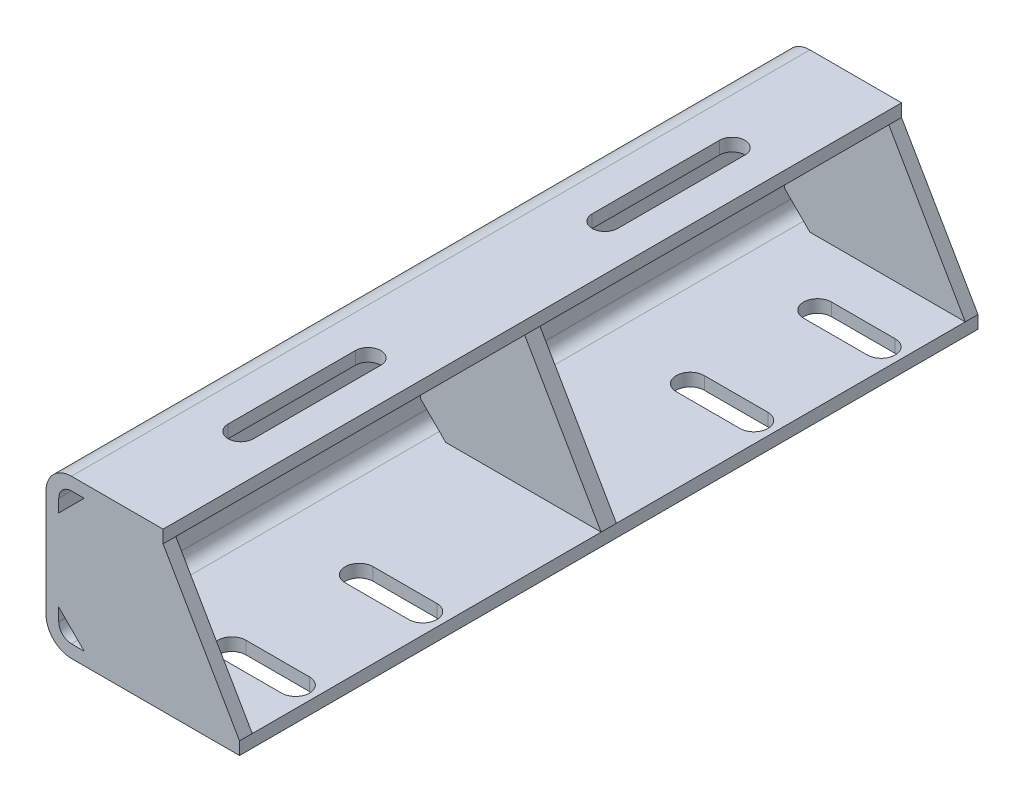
ISO-10303-21;
HEADER;
FILE_DESCRIPTION(('STEP AP214'),'2;1');
FILE_NAME('part.step','',(''),(''),'','','');
FILE_SCHEMA(('AUTOMOTIVE_DESIGN { 1 0 10303 214 1 1 1 1 }'));
ENDSEC;
DATA;
#1=APPLICATION_CONTEXT('core data for automotive mechanical design processes');
#2=APPLICATION_PROTOCOL_DEFINITION('international standard','automotive_design',2000,#1);
#3=PRODUCT_CONTEXT('',#1,'mechanical');
#4=PRODUCT('Part','Part','',(#3));
#5=PRODUCT_RELATED_PRODUCT_CATEGORY('part','',(#4));
#6=PRODUCT_DEFINITION_FORMATION('','',#4);
#7=PRODUCT_DEFINITION_CONTEXT('part definition',#1,'design');
#8=PRODUCT_DEFINITION('design','',#6,#7);
#9=PRODUCT_DEFINITION_SHAPE('','',#8);
#10=(LENGTH_UNIT() NAMED_UNIT(*) SI_UNIT(.MILLI.,.METRE.));
#11=(NAMED_UNIT(*) PLANE_ANGLE_UNIT() SI_UNIT($,.RADIAN.));
#12=(NAMED_UNIT(*) SI_UNIT($,.STERADIAN.) SOLID_ANGLE_UNIT());
#13=UNCERTAINTY_MEASURE_WITH_UNIT(LENGTH_MEASURE(1.E-05),#10,'distance_accuracy_value','');
#14=(GEOMETRIC_REPRESENTATION_CONTEXT(3) GLOBAL_UNCERTAINTY_ASSIGNED_CONTEXT((#13)) GLOBAL_UNIT_ASSIGNED_CONTEXT((#10,
#11,#12)) REPRESENTATION_CONTEXT('',''));
#15=CARTESIAN_POINT('',(0.,0.,0.));
#16=DIRECTION('',(0.,0.,1.));
#17=DIRECTION('',(1.,0.,0.));
#18=AXIS2_PLACEMENT_3D('',#15,#16,#17);
#19=CARTESIAN_POINT('',(10.,5.,290.));
#20=DIRECTION('',(0.,-1.,0.));
#21=DIRECTION('',(0.,0.,-1.));
#22=AXIS2_PLACEMENT_3D('',#19,#20,#21);
#23=PLANE('',#22);
#24=DIRECTION('',(-1.,0.,0.));
#25=VECTOR('',#24,1.);
#26=CARTESIAN_POINT('',(10.,5.,215.5));
#27=LINE('',#26,#25);
#28=CARTESIAN_POINT('',(68.,5.,215.5));
#29=VERTEX_POINT('',#28);
#30=CARTESIAN_POINT('',(43.,5.,215.5));
#31=VERTEX_POINT('',#30);
#32=EDGE_CURVE('E392',#29,#31,#27,.T.);
#33=ORIENTED_EDGE('',*,*,#32,.T.);
#34=CARTESIAN_POINT('',(43.,5.,210.));
#35=DIRECTION('',(0.,-1.,0.));
#36=DIRECTION('',(0.,0.,-1.));
#37=AXIS2_PLACEMENT_3D('',#34,#35,#36);
#38=CIRCLE('',#37,5.50000000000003);
#39=CARTESIAN_POINT('',(43.,5.,204.5));
#40=VERTEX_POINT('',#39);
#41=EDGE_CURVE('E395',#31,#40,#38,.T.);
#42=ORIENTED_EDGE('',*,*,#41,.T.);
#43=DIRECTION('',(1.,0.,0.));
#44=VECTOR('',#43,1.);
#45=CARTESIAN_POINT('',(10.,5.,204.5));
#46=LINE('',#45,#44);
#47=CARTESIAN_POINT('',(68.,5.,204.5));
#48=VERTEX_POINT('',#47);
#49=EDGE_CURVE('E387',#40,#48,#46,.T.);
#50=ORIENTED_EDGE('',*,*,#49,.T.);
#51=CARTESIAN_POINT('',(68.,5.,210.));
#52=DIRECTION('',(0.,-1.,0.));
#53=DIRECTION('',(0.,0.,-1.));
#54=AXIS2_PLACEMENT_3D('',#51,#52,#53);
#55=CIRCLE('',#54,5.50000000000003);
#56=EDGE_CURVE('E367',#48,#29,#55,.T.);
#57=ORIENTED_EDGE('',*,*,#56,.T.);
#58=EDGE_LOOP('',(#33,#42,#50,#57));
#59=FACE_BOUND('',#58,.T.);
#60=DIRECTION('',(-1.,0.,0.));
#61=VECTOR('',#60,1.);
#62=CARTESIAN_POINT('',(10.0000000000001,5.,35.5));
#63=LINE('',#62,#61);
#64=CARTESIAN_POINT('',(68.,5.,35.5));
#65=VERTEX_POINT('',#64);
#66=CARTESIAN_POINT('',(43.0000000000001,5.,35.5));
#67=VERTEX_POINT('',#66);
#68=EDGE_CURVE('E424',#65,#67,#63,.T.);
#69=ORIENTED_EDGE('',*,*,#68,.T.);
#70=CARTESIAN_POINT('',(43.0000000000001,5.,30.));
#71=DIRECTION('',(0.,-1.,0.));
#72=DIRECTION('',(0.,0.,-1.));
#73=AXIS2_PLACEMENT_3D('',#70,#71,#72);
#74=CIRCLE('',#73,5.50000000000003);
#75=CARTESIAN_POINT('',(43.0000000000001,5.,24.5));
#76=VERTEX_POINT('',#75);
#77=EDGE_CURVE('E427',#67,#76,#74,.T.);
#78=ORIENTED_EDGE('',*,*,#77,.T.);
#79=DIRECTION('',(1.,0.,0.));
#80=VECTOR('',#79,1.);
#81=CARTESIAN_POINT('',(10.0000000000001,5.,24.5));
#82=LINE('',#81,#80);
#83=CARTESIAN_POINT('',(68.,5.,24.5));
#84=VERTEX_POINT('',#83);
#85=EDGE_CURVE('E412',#76,#84,#82,.T.);
#86=ORIENTED_EDGE('',*,*,#85,.T.);
#87=CARTESIAN_POINT('',(68.0000000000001,5.,30.));
#88=DIRECTION('',(0.,-1.,0.));
#89=DIRECTION('',(0.,0.,-1.));
#90=AXIS2_PLACEMENT_3D('',#87,#88,#89);
#91=CIRCLE('',#90,5.50000000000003);
#92=EDGE_CURVE('E421',#84,#65,#91,.T.);
#93=ORIENTED_EDGE('',*,*,#92,.T.);
#94=EDGE_LOOP('',(#69,#78,#86,#93));
#95=FACE_BOUND('',#94,.T.);
#96=DIRECTION('',(-1.,0.,0.));
#97=VECTOR('',#96,1.);
#98=CARTESIAN_POINT('',(10.,5.,85.5));
#99=LINE('',#98,#97);
#100=CARTESIAN_POINT('',(68.0000000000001,5.,85.5));
#101=VERTEX_POINT('',#100);
#102=CARTESIAN_POINT('',(43.0000000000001,5.,85.5));
#103=VERTEX_POINT('',#102);
#104=EDGE_CURVE('E456',#101,#103,#99,.T.);
#105=ORIENTED_EDGE('',*,*,#104,.T.);
#106=CARTESIAN_POINT('',(43.0000000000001,5.,80.));
#107=DIRECTION('',(0.,-1.,0.));
#108=DIRECTION('',(0.,0.,-1.));
#109=AXIS2_PLACEMENT_3D('',#106,#107,#108);
#110=CIRCLE('',#109,5.50000000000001);
#111=CARTESIAN_POINT('',(43.0000000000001,5.,74.5));
#112=VERTEX_POINT('',#111);
#113=EDGE_CURVE('E459',#103,#112,#110,.T.);
#114=ORIENTED_EDGE('',*,*,#113,.T.);
#115=DIRECTION('',(1.,0.,0.));
#116=VECTOR('',#115,1.);
#117=CARTESIAN_POINT('',(10.,5.,74.5));
#118=LINE('',#117,#116);
#119=CARTESIAN_POINT('',(68.0000000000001,5.,74.5));
#120=VERTEX_POINT('',#119);
#121=EDGE_CURVE('E444',#112,#120,#118,.T.);
#122=ORIENTED_EDGE('',*,*,#121,.T.);
#123=CARTESIAN_POINT('',(68.0000000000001,5.,80.));
#124=DIRECTION('',(0.,-1.,0.));
#125=DIRECTION('',(0.,0.,-1.));
#126=AXIS2_PLACEMENT_3D('',#123,#124,#125);
#127=CIRCLE('',#126,5.50000000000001);
#128=EDGE_CURVE('E453',#120,#101,#127,.T.);
#129=ORIENTED_EDGE('',*,*,#128,.T.);
#130=EDGE_LOOP('',(#105,#114,#122,#129));
#131=FACE_BOUND('',#130,.T.);
#132=DIRECTION('',(-1.,0.,0.));
#133=VECTOR('',#132,1.);
#134=CARTESIAN_POINT('',(10.,5.,265.5));
#135=LINE('',#134,#133);
#136=CARTESIAN_POINT('',(68.,5.,265.5));
#137=VERTEX_POINT('',#136);
#138=CARTESIAN_POINT('',(43.,5.,265.5));
#139=VERTEX_POINT('',#138);
#140=EDGE_CURVE('E488',#137,#139,#135,.T.);
#141=ORIENTED_EDGE('',*,*,#140,.T.);
#142=CARTESIAN_POINT('',(43.,5.,260.));
#143=DIRECTION('',(0.,-1.,0.));
#144=DIRECTION('',(0.,0.,-1.));
#145=AXIS2_PLACEMENT_3D('',#142,#143,#144);
#146=CIRCLE('',#145,5.50000000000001);
#147=CARTESIAN_POINT('',(43.,5.,254.5));
#148=VERTEX_POINT('',#147);
#149=EDGE_CURVE('E491',#139,#148,#146,.T.);
#150=ORIENTED_EDGE('',*,*,#149,.T.);
#151=DIRECTION('',(1.,0.,0.));
#152=VECTOR('',#151,1.);
#153=CARTESIAN_POINT('',(10.,5.,254.5));
#154=LINE('',#153,#152);
#155=CARTESIAN_POINT('',(68.,5.,254.5));
#156=VERTEX_POINT('',#155);
#157=EDGE_CURVE('E476',#148,#156,#154,.T.);
#158=ORIENTED_EDGE('',*,*,#157,.T.);
#159=CARTESIAN_POINT('',(68.,5.,260.));
#160=DIRECTION('',(0.,-1.,0.));
#161=DIRECTION('',(0.,0.,-1.));
#162=AXIS2_PLACEMENT_3D('',#159,#160,#161);
#163=CIRCLE('',#162,5.50000000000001);
#164=EDGE_CURVE('E485',#156,#137,#163,.T.);
#165=ORIENTED_EDGE('',*,*,#164,.T.);
#166=EDGE_LOOP('',(#141,#150,#158,#165));
#167=FACE_BOUND('',#166,.T.);
#168=DIRECTION('',(1.,0.,0.));
#169=VECTOR('',#168,1.);
#170=CARTESIAN_POINT('',(15.,5.00000000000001,5.));
#171=LINE('',#170,#169);
#172=CARTESIAN_POINT('',(15.,5.,5.));
#173=VERTEX_POINT('',#172);
#174=CARTESIAN_POINT('',(76.,5.,5.));
#175=VERTEX_POINT('',#174);
#176=EDGE_CURVE('E578',#173,#175,#171,.T.);
#177=ORIENTED_EDGE('',*,*,#176,.F.);
#178=DIRECTION('',(0.,0.,1.));
#179=VECTOR('',#178,1.);
#180=CARTESIAN_POINT('',(15.,5.00000000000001,0.));
#181=LINE('',#180,#179);
#182=CARTESIAN_POINT('',(15.,5.00000000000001,0.));
#183=VERTEX_POINT('',#182);
#184=EDGE_CURVE('E594',#183,#173,#181,.T.);
#185=ORIENTED_EDGE('',*,*,#184,.F.);
#186=DIRECTION('',(-1.,0.,0.));
#187=VECTOR('',#186,1.);
#188=CARTESIAN_POINT('',(10.,5.,0.));
#189=LINE('',#188,#187);
#190=CARTESIAN_POINT('',(10.,5.,0.));
#191=VERTEX_POINT('',#190);
#192=EDGE_CURVE('E715',#183,#191,#189,.T.);
#193=ORIENTED_EDGE('',*,*,#192,.T.);
#194=DIRECTION('',(0.,0.,-1.));
#195=VECTOR('',#194,1.);
#196=CARTESIAN_POINT('',(10.,5.,290.));
#197=LINE('',#196,#195);
#198=CARTESIAN_POINT('',(10.,5.,290.));
#199=VERTEX_POINT('',#198);
#200=EDGE_CURVE('E767',#199,#191,#197,.T.);
#201=ORIENTED_EDGE('',*,*,#200,.F.);
#202=DIRECTION('',(-1.,0.,0.));
#203=VECTOR('',#202,1.);
#204=CARTESIAN_POINT('',(71.,5.,290.));
#205=LINE('',#204,#203);
#206=CARTESIAN_POINT('',(15.,4.99999999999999,290.));
#207=VERTEX_POINT('',#206);
#208=EDGE_CURVE('E687',#207,#199,#205,.T.);
#209=ORIENTED_EDGE('',*,*,#208,.F.);
#210=DIRECTION('',(0.,0.,1.));
#211=VECTOR('',#210,1.);
#212=CARTESIAN_POINT('',(15.,5.00000000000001,285.));
#213=LINE('',#212,#211);
#214=CARTESIAN_POINT('',(15.,5.00000000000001,285.));
#215=VERTEX_POINT('',#214);
#216=EDGE_CURVE('E676',#215,#207,#213,.T.);
#217=ORIENTED_EDGE('',*,*,#216,.F.);
#218=DIRECTION('',(1.,0.,0.));
#219=VECTOR('',#218,1.);
#220=CARTESIAN_POINT('',(15.,5.00000000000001,285.));
#221=LINE('',#220,#219);
#222=CARTESIAN_POINT('',(76.,5.,285.));
#223=VERTEX_POINT('',#222);
#224=EDGE_CURVE('E659',#215,#223,#221,.T.);
#225=ORIENTED_EDGE('',*,*,#224,.T.);
#226=DIRECTION('',(0.,0.,-1.));
#227=VECTOR('',#226,1.);
#228=CARTESIAN_POINT('',(76.,5.,290.));
#229=LINE('',#228,#227);
#230=CARTESIAN_POINT('',(76.,5.,148.));
#231=VERTEX_POINT('',#230);
#232=EDGE_CURVE('E40',#223,#231,#229,.T.);
#233=ORIENTED_EDGE('',*,*,#232,.T.);
#234=DIRECTION('',(1.,0.,0.));
#235=VECTOR('',#234,1.);
#236=CARTESIAN_POINT('',(15.,5.00000000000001,148.));
#237=LINE('',#236,#235);
#238=CARTESIAN_POINT('',(15.,5.,148.));
#239=VERTEX_POINT('',#238);
#240=EDGE_CURVE('E609',#239,#231,#237,.T.);
#241=ORIENTED_EDGE('',*,*,#240,.F.);
#242=DIRECTION('',(0.,0.,1.));
#243=VECTOR('',#242,1.);
#244=CARTESIAN_POINT('',(15.,5.00000000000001,142.));
#245=LINE('',#244,#243);
#246=CARTESIAN_POINT('',(15.,5.00000000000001,142.));
#247=VERTEX_POINT('',#246);
#248=EDGE_CURVE('E644',#247,#239,#245,.T.);
#249=ORIENTED_EDGE('',*,*,#248,.F.);
#250=DIRECTION('',(1.,0.,0.));
#251=VECTOR('',#250,1.);
#252=CARTESIAN_POINT('',(15.,5.00000000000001,142.));
#253=LINE('',#252,#251);
#254=CARTESIAN_POINT('',(76.,5.,142.));
#255=VERTEX_POINT('',#254);
#256=EDGE_CURVE('E627',#247,#255,#253,.T.);
#257=ORIENTED_EDGE('',*,*,#256,.T.);
#258=EDGE_CURVE('E41',#255,#175,#229,.T.);
#259=ORIENTED_EDGE('',*,*,#258,.T.);
#260=EDGE_LOOP('',(#177,#185,#193,#201,#209,#217,#225,#233,#241,#249,#257,#259));
#261=FACE_BOUND('',#260,.T.);
#262=ADVANCED_FACE('F32',(#59,#95,#131,#167,#261),#23,.F.);
#263=CARTESIAN_POINT('',(5.,52.,290.));
#264=DIRECTION('',(-1.,0.,0.));
#265=DIRECTION('',(0.,-1.,0.));
#266=AXIS2_PLACEMENT_3D('',#263,#264,#265);
#267=PLANE('',#266);
#268=DIRECTION('',(0.,-1.,0.));
#269=VECTOR('',#268,1.);
#270=CARTESIAN_POINT('',(5.00000000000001,47.,5.));
#271=LINE('',#270,#269);
#272=CARTESIAN_POINT('',(5.,47.,5.));
#273=VERTEX_POINT('',#272);
#274=CARTESIAN_POINT('',(5.00000000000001,15.,5.));
#275=VERTEX_POINT('',#274);
#276=EDGE_CURVE('E572',#273,#275,#271,.T.);
#277=ORIENTED_EDGE('',*,*,#276,.F.);
#278=DIRECTION('',(0.,0.,1.));
#279=VECTOR('',#278,1.);
#280=CARTESIAN_POINT('',(5.00000000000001,47.,0.));
#281=LINE('',#280,#279);
#282=CARTESIAN_POINT('',(5.00000000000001,47.,0.));
#283=VERTEX_POINT('',#282);
#284=EDGE_CURVE('E569',#283,#273,#281,.T.);
#285=ORIENTED_EDGE('',*,*,#284,.F.);
#286=DIRECTION('',(0.,1.,0.));
#287=VECTOR('',#286,1.);
#288=CARTESIAN_POINT('',(5.,52.,0.));
#289=LINE('',#288,#287);
#290=CARTESIAN_POINT('',(5.,52.,0.));
#291=VERTEX_POINT('',#290);
#292=EDGE_CURVE('E719',#283,#291,#289,.T.);
#293=ORIENTED_EDGE('',*,*,#292,.T.);
#294=DIRECTION('',(0.,0.,-1.));
#295=VECTOR('',#294,1.);
#296=CARTESIAN_POINT('',(5.,52.,290.));
#297=LINE('',#296,#295);
#298=CARTESIAN_POINT('',(5.,52.,290.));
#299=VERTEX_POINT('',#298);
#300=EDGE_CURVE('E762',#299,#291,#297,.T.);
#301=ORIENTED_EDGE('',*,*,#300,.F.);
#302=DIRECTION('',(0.,1.,0.));
#303=VECTOR('',#302,1.);
#304=CARTESIAN_POINT('',(5.,52.,290.));
#305=LINE('',#304,#303);
#306=CARTESIAN_POINT('',(5.,47.,290.));
#307=VERTEX_POINT('',#306);
#308=EDGE_CURVE('E692',#307,#299,#305,.T.);
#309=ORIENTED_EDGE('',*,*,#308,.F.);
#310=DIRECTION('',(0.,0.,1.));
#311=VECTOR('',#310,1.);
#312=CARTESIAN_POINT('',(5.00000000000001,47.,285.));
#313=LINE('',#312,#311);
#314=CARTESIAN_POINT('',(5.00000000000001,47.,285.));
#315=VERTEX_POINT('',#314);
#316=EDGE_CURVE('E667',#315,#307,#313,.T.);
#317=ORIENTED_EDGE('',*,*,#316,.F.);
#318=DIRECTION('',(0.,-1.,0.));
#319=VECTOR('',#318,1.);
#320=CARTESIAN_POINT('',(5.00000000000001,47.,285.));
#321=LINE('',#320,#319);
#322=CARTESIAN_POINT('',(5.00000000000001,15.,285.));
#323=VERTEX_POINT('',#322);
#324=EDGE_CURVE('E652',#315,#323,#321,.T.);
#325=ORIENTED_EDGE('',*,*,#324,.T.);
#326=DIRECTION('',(0.,0.,1.));
#327=VECTOR('',#326,1.);
#328=CARTESIAN_POINT('',(5.00000000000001,15.,285.));
#329=LINE('',#328,#327);
#330=CARTESIAN_POINT('',(5.00000000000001,15.,290.));
#331=VERTEX_POINT('',#330);
#332=EDGE_CURVE('E679',#323,#331,#329,.T.);
#333=ORIENTED_EDGE('',*,*,#332,.T.);
#334=CARTESIAN_POINT('',(5.00000000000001,10.,290.));
#335=VERTEX_POINT('',#334);
#336=EDGE_CURVE('E693',#335,#331,#305,.T.);
#337=ORIENTED_EDGE('',*,*,#336,.F.);
#338=DIRECTION('',(0.,0.,-1.));
#339=VECTOR('',#338,1.);
#340=CARTESIAN_POINT('',(5.00000000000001,10.,290.));
#341=LINE('',#340,#339);
#342=CARTESIAN_POINT('',(5.00000000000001,10.,0.));
#343=VERTEX_POINT('',#342);
#344=EDGE_CURVE('E765',#335,#343,#341,.T.);
#345=ORIENTED_EDGE('',*,*,#344,.T.);
#346=CARTESIAN_POINT('',(5.00000000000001,15.,0.));
#347=VERTEX_POINT('',#346);
#348=EDGE_CURVE('E720',#343,#347,#289,.T.);
#349=ORIENTED_EDGE('',*,*,#348,.T.);
#350=DIRECTION('',(0.,0.,1.));
#351=VECTOR('',#350,1.);
#352=CARTESIAN_POINT('',(5.00000000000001,15.,0.));
#353=LINE('',#352,#351);
#354=EDGE_CURVE('E597',#347,#275,#353,.T.);
#355=ORIENTED_EDGE('',*,*,#354,.T.);
#356=EDGE_LOOP('',(#277,#285,#293,#301,#309,#317,#325,#333,#337,#345,#349,#355));
#357=FACE_BOUND('',#356,.T.);
#358=DIRECTION('',(0.,-1.,0.));
#359=VECTOR('',#358,1.);
#360=CARTESIAN_POINT('',(5.00000000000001,47.,148.));
#361=LINE('',#360,#359);
#362=CARTESIAN_POINT('',(5.,47.,148.));
#363=VERTEX_POINT('',#362);
#364=CARTESIAN_POINT('',(5.00000000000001,15.,148.));
#365=VERTEX_POINT('',#364);
#366=EDGE_CURVE('E603',#363,#365,#361,.T.);
#367=ORIENTED_EDGE('',*,*,#366,.F.);
#368=DIRECTION('',(0.,0.,1.));
#369=VECTOR('',#368,1.);
#370=CARTESIAN_POINT('',(5.00000000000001,47.,142.));
#371=LINE('',#370,#369);
#372=CARTESIAN_POINT('',(5.00000000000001,47.,142.));
#373=VERTEX_POINT('',#372);
#374=EDGE_CURVE('E636',#373,#363,#371,.T.);
#375=ORIENTED_EDGE('',*,*,#374,.F.);
#376=DIRECTION('',(0.,-1.,0.));
#377=VECTOR('',#376,1.);
#378=CARTESIAN_POINT('',(5.00000000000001,47.,142.));
#379=LINE('',#378,#377);
#380=CARTESIAN_POINT('',(5.00000000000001,15.,142.));
#381=VERTEX_POINT('',#380);
#382=EDGE_CURVE('E621',#373,#381,#379,.T.);
#383=ORIENTED_EDGE('',*,*,#382,.T.);
#384=DIRECTION('',(0.,0.,1.));
#385=VECTOR('',#384,1.);
#386=CARTESIAN_POINT('',(5.00000000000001,15.,142.));
#387=LINE('',#386,#385);
#388=EDGE_CURVE('E646',#381,#365,#387,.T.);
#389=ORIENTED_EDGE('',*,*,#388,.T.);
#390=EDGE_LOOP('',(#367,#375,#383,#389));
#391=FACE_BOUND('',#390,.T.);
#392=ADVANCED_FACE('F840',(#357,#391),#267,.F.);
#393=CARTESIAN_POINT('',(10.,57.,290.));
#394=DIRECTION('',(0.,1.,0.));
#395=DIRECTION('',(-1.,0.,0.));
#396=AXIS2_PLACEMENT_3D('',#393,#394,#395);
#397=PLANE('',#396);
#398=DIRECTION('',(0.,0.,-1.));
#399=VECTOR('',#398,1.);
#400=CARTESIAN_POINT('',(32.9888930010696,57.,290.));
#401=LINE('',#400,#399);
#402=CARTESIAN_POINT('',(32.9888930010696,57.,241.5));
#403=VERTEX_POINT('',#402);
#404=CARTESIAN_POINT('',(32.9888930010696,57.,191.5));
#405=VERTEX_POINT('',#404);
#406=EDGE_CURVE('E520',#403,#405,#401,.T.);
#407=ORIENTED_EDGE('',*,*,#406,.T.);
#408=CARTESIAN_POINT('',(27.9888930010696,57.,191.5));
#409=DIRECTION('',(0.,1.,0.));
#410=DIRECTION('',(-1.,0.,0.));
#411=AXIS2_PLACEMENT_3D('',#408,#409,#410);
#412=CIRCLE('',#411,4.99999999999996);
#413=CARTESIAN_POINT('',(22.9888930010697,57.,191.5));
#414=VERTEX_POINT('',#413);
#415=EDGE_CURVE('E523',#405,#414,#412,.T.);
#416=ORIENTED_EDGE('',*,*,#415,.T.);
#417=DIRECTION('',(0.,0.,1.));
#418=VECTOR('',#417,1.);
#419=CARTESIAN_POINT('',(22.9888930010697,57.,290.));
#420=LINE('',#419,#418);
#421=CARTESIAN_POINT('',(22.9888930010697,57.,241.5));
#422=VERTEX_POINT('',#421);
#423=EDGE_CURVE('E508',#414,#422,#420,.T.);
#424=ORIENTED_EDGE('',*,*,#423,.T.);
#425=CARTESIAN_POINT('',(27.9888930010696,57.,241.5));
#426=DIRECTION('',(0.,1.,0.));
#427=DIRECTION('',(-1.,0.,0.));
#428=AXIS2_PLACEMENT_3D('',#425,#426,#427);
#429=CIRCLE('',#428,4.99999999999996);
#430=EDGE_CURVE('E517',#422,#403,#429,.T.);
#431=ORIENTED_EDGE('',*,*,#430,.T.);
#432=EDGE_LOOP('',(#407,#416,#424,#431));
#433=FACE_BOUND('',#432,.T.);
#434=DIRECTION('',(0.,0.,-1.));
#435=VECTOR('',#434,1.);
#436=CARTESIAN_POINT('',(32.9888930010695,57.,290.));
#437=LINE('',#436,#435);
#438=CARTESIAN_POINT('',(32.9888930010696,57.,98.5));
#439=VERTEX_POINT('',#438);
#440=CARTESIAN_POINT('',(32.9888930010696,57.,48.5));
#441=VERTEX_POINT('',#440);
#442=EDGE_CURVE('E552',#439,#441,#437,.T.);
#443=ORIENTED_EDGE('',*,*,#442,.T.);
#444=CARTESIAN_POINT('',(27.9888930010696,57.,48.5));
#445=DIRECTION('',(0.,1.,0.));
#446=DIRECTION('',(-1.,0.,0.));
#447=AXIS2_PLACEMENT_3D('',#444,#445,#446);
#448=CIRCLE('',#447,4.99999999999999);
#449=CARTESIAN_POINT('',(22.9888930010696,57.,48.5));
#450=VERTEX_POINT('',#449);
#451=EDGE_CURVE('E555',#441,#450,#448,.T.);
#452=ORIENTED_EDGE('',*,*,#451,.T.);
#453=DIRECTION('',(0.,0.,1.));
#454=VECTOR('',#453,1.);
#455=CARTESIAN_POINT('',(22.9888930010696,57.,290.));
#456=LINE('',#455,#454);
#457=CARTESIAN_POINT('',(22.9888930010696,57.,98.5));
#458=VERTEX_POINT('',#457);
#459=EDGE_CURVE('E540',#450,#458,#456,.T.);
#460=ORIENTED_EDGE('',*,*,#459,.T.);
#461=CARTESIAN_POINT('',(27.9888930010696,57.,98.5));
#462=DIRECTION('',(0.,1.,0.));
#463=DIRECTION('',(-1.,0.,0.));
#464=AXIS2_PLACEMENT_3D('',#461,#462,#463);
#465=CIRCLE('',#464,4.99999999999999);
#466=EDGE_CURVE('E549',#458,#439,#465,.T.);
#467=ORIENTED_EDGE('',*,*,#466,.T.);
#468=EDGE_LOOP('',(#443,#452,#460,#467));
#469=FACE_BOUND('',#468,.T.);
#470=DIRECTION('',(1.,0.,0.));
#471=VECTOR('',#470,1.);
#472=CARTESIAN_POINT('',(10.,57.,0.));
#473=LINE('',#472,#471);
#474=CARTESIAN_POINT('',(10.,57.,0.));
#475=VERTEX_POINT('',#474);
#476=CARTESIAN_POINT('',(15.,57.,0.));
#477=VERTEX_POINT('',#476);
#478=EDGE_CURVE('E724',#475,#477,#473,.T.);
#479=ORIENTED_EDGE('',*,*,#478,.T.);
#480=DIRECTION('',(0.,0.,1.));
#481=VECTOR('',#480,1.);
#482=CARTESIAN_POINT('',(15.,57.,0.));
#483=LINE('',#482,#481);
#484=CARTESIAN_POINT('',(15.,57.,5.));
#485=VERTEX_POINT('',#484);
#486=EDGE_CURVE('E586',#477,#485,#483,.T.);
#487=ORIENTED_EDGE('',*,*,#486,.T.);
#488=DIRECTION('',(-1.,0.,0.));
#489=VECTOR('',#488,1.);
#490=CARTESIAN_POINT('',(15.,57.,5.));
#491=LINE('',#490,#489);
#492=CARTESIAN_POINT('',(45.9777860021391,57.,5.));
#493=VERTEX_POINT('',#492);
#494=EDGE_CURVE('E563',#493,#485,#491,.T.);
#495=ORIENTED_EDGE('',*,*,#494,.F.);
#496=DIRECTION('',(0.,0.,-1.));
#497=VECTOR('',#496,1.);
#498=CARTESIAN_POINT('',(45.9777860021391,57.,290.));
#499=LINE('',#498,#497);
#500=CARTESIAN_POINT('',(45.9777860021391,57.,142.));
#501=VERTEX_POINT('',#500);
#502=EDGE_CURVE('E754',#501,#493,#499,.T.);
#503=ORIENTED_EDGE('',*,*,#502,.F.);
#504=DIRECTION('',(-1.,0.,0.));
#505=VECTOR('',#504,1.);
#506=CARTESIAN_POINT('',(15.,57.,142.));
#507=LINE('',#506,#505);
#508=CARTESIAN_POINT('',(15.,57.,142.));
#509=VERTEX_POINT('',#508);
#510=EDGE_CURVE('E633',#501,#509,#507,.T.);
#511=ORIENTED_EDGE('',*,*,#510,.T.);
#512=DIRECTION('',(0.,0.,1.));
#513=VECTOR('',#512,1.);
#514=CARTESIAN_POINT('',(15.,57.,142.));
#515=LINE('',#514,#513);
#516=CARTESIAN_POINT('',(15.,57.,148.));
#517=VERTEX_POINT('',#516);
#518=EDGE_CURVE('E637',#509,#517,#515,.T.);
#519=ORIENTED_EDGE('',*,*,#518,.T.);
#520=DIRECTION('',(-1.,0.,0.));
#521=VECTOR('',#520,1.);
#522=CARTESIAN_POINT('',(15.,57.,148.));
#523=LINE('',#522,#521);
#524=CARTESIAN_POINT('',(45.9777860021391,57.,148.));
#525=VERTEX_POINT('',#524);
#526=EDGE_CURVE('E615',#525,#517,#523,.T.);
#527=ORIENTED_EDGE('',*,*,#526,.F.);
#528=CARTESIAN_POINT('',(45.9777860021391,57.,285.));
#529=VERTEX_POINT('',#528);
#530=EDGE_CURVE('E759',#529,#525,#499,.T.);
#531=ORIENTED_EDGE('',*,*,#530,.F.);
#532=DIRECTION('',(-1.,0.,0.));
#533=VECTOR('',#532,1.);
#534=CARTESIAN_POINT('',(15.,57.,285.));
#535=LINE('',#534,#533);
#536=CARTESIAN_POINT('',(15.,57.,285.));
#537=VERTEX_POINT('',#536);
#538=EDGE_CURVE('E664',#529,#537,#535,.T.);
#539=ORIENTED_EDGE('',*,*,#538,.T.);
#540=DIRECTION('',(0.,0.,1.));
#541=VECTOR('',#540,1.);
#542=CARTESIAN_POINT('',(15.,57.,285.));
#543=LINE('',#542,#541);
#544=CARTESIAN_POINT('',(15.,57.,290.));
#545=VERTEX_POINT('',#544);
#546=EDGE_CURVE('E672',#537,#545,#543,.T.);
#547=ORIENTED_EDGE('',*,*,#546,.T.);
#548=DIRECTION('',(1.,0.,0.));
#549=VECTOR('',#548,1.);
#550=CARTESIAN_POINT('',(10.,57.,290.));
#551=LINE('',#550,#549);
#552=CARTESIAN_POINT('',(10.,57.,290.));
#553=VERTEX_POINT('',#552);
#554=EDGE_CURVE('E698',#553,#545,#551,.T.);
#555=ORIENTED_EDGE('',*,*,#554,.F.);
#556=DIRECTION('',(0.,0.,-1.));
#557=VECTOR('',#556,1.);
#558=CARTESIAN_POINT('',(10.,57.,290.));
#559=LINE('',#558,#557);
#560=EDGE_CURVE('E758',#553,#475,#559,.T.);
#561=ORIENTED_EDGE('',*,*,#560,.T.);
#562=EDGE_LOOP('',(#479,#487,#495,#503,#511,#519,#527,#531,#539,#547,#555,#561));
#563=FACE_BOUND('',#562,.T.);
#564=ADVANCED_FACE('F849',(#433,#469,#563),#397,.F.);
#565=CARTESIAN_POINT('',(76.,0.,290.));
#566=DIRECTION('',(-1.,0.,0.));
#567=DIRECTION('',(0.,0.,1.));
#568=AXIS2_PLACEMENT_3D('',#565,#566,#567);
#569=PLANE('',#568);
#570=DIRECTION('',(0.,1.,0.));
#571=VECTOR('',#570,1.);
#572=CARTESIAN_POINT('',(76.,0.,0.));
#573=LINE('',#572,#571);
#574=CARTESIAN_POINT('',(76.,0.,0.));
#575=VERTEX_POINT('',#574);
#576=CARTESIAN_POINT('',(76.,5.,0.));
#577=VERTEX_POINT('',#576);
#578=EDGE_CURVE('E675',#575,#577,#573,.T.);
#579=ORIENTED_EDGE('',*,*,#578,.T.);
#580=DIRECTION('',(0.,0.,1.));
#581=VECTOR('',#580,1.);
#582=CARTESIAN_POINT('',(76.,5.,0.));
#583=LINE('',#582,#581);
#584=EDGE_CURVE('E592',#577,#175,#583,.T.);
#585=ORIENTED_EDGE('',*,*,#584,.T.);
#586=ORIENTED_EDGE('',*,*,#258,.F.);
#587=DIRECTION('',(0.,0.,1.));
#588=VECTOR('',#587,1.);
#589=CARTESIAN_POINT('',(76.,5.,142.));
#590=LINE('',#589,#588);
#591=EDGE_CURVE('E642',#255,#231,#590,.T.);
#592=ORIENTED_EDGE('',*,*,#591,.T.);
#593=ORIENTED_EDGE('',*,*,#232,.F.);
#594=CARTESIAN_POINT('',(76.,5.,290.));
#595=VERTEX_POINT('',#594);
#596=EDGE_CURVE('E11',#595,#223,#229,.T.);
#597=ORIENTED_EDGE('',*,*,#596,.F.);
#598=DIRECTION('',(0.,1.,0.));
#599=VECTOR('',#598,1.);
#600=CARTESIAN_POINT('',(76.,0.,290.));
#601=LINE('',#600,#599);
#602=CARTESIAN_POINT('',(76.,0.,290.));
#603=VERTEX_POINT('',#602);
#604=EDGE_CURVE('E684',#603,#595,#601,.T.);
#605=ORIENTED_EDGE('',*,*,#604,.F.);
#606=DIRECTION('',(0.,0.,-1.));
#607=VECTOR('',#606,1.);
#608=CARTESIAN_POINT('',(76.,0.,290.));
#609=LINE('',#608,#607);
#610=EDGE_CURVE('E713',#603,#575,#609,.T.);
#611=ORIENTED_EDGE('',*,*,#610,.T.);
#612=EDGE_LOOP('',(#579,#585,#586,#592,#593,#597,#605,#611));
#613=FACE_BOUND('',#612,.T.);
#614=ADVANCED_FACE('F34',(#613),#569,.F.);
#615=CARTESIAN_POINT('',(10.,10.,290.));
#616=DIRECTION('',(0.,0.,-1.));
#617=DIRECTION('',(-1.,0.,0.));
#618=AXIS2_PLACEMENT_3D('',#615,#616,#617);
#619=CYLINDRICAL_SURFACE('',#618,5.);
#620=CARTESIAN_POINT('',(10.,10.,0.));
#621=DIRECTION('',(0.,0.,-1.));
#622=DIRECTION('',(1.,0.,0.));
#623=AXIS2_PLACEMENT_3D('',#620,#621,#622);
#624=CIRCLE('',#623,5.);
#625=EDGE_CURVE('E717',#191,#343,#624,.T.);
#626=ORIENTED_EDGE('',*,*,#625,.T.);
#627=ORIENTED_EDGE('',*,*,#344,.F.);
#628=CARTESIAN_POINT('',(10.,10.,290.));
#629=DIRECTION('',(0.,0.,-1.));
#630=DIRECTION('',(1.,0.,0.));
#631=AXIS2_PLACEMENT_3D('',#628,#629,#630);
#632=CIRCLE('',#631,5.);
#633=EDGE_CURVE('E690',#199,#335,#632,.T.);
#634=ORIENTED_EDGE('',*,*,#633,.F.);
#635=ORIENTED_EDGE('',*,*,#200,.T.);
#636=EDGE_LOOP('',(#626,#627,#634,#635));
#637=FACE_BOUND('',#636,.T.);
#638=ADVANCED_FACE('F826',(#637),#619,.F.);
#639=CARTESIAN_POINT('',(10.,52.,290.));
#640=DIRECTION('',(0.,0.,-1.));
#641=DIRECTION('',(-1.,0.,0.));
#642=AXIS2_PLACEMENT_3D('',#639,#640,#641);
#643=CYLINDRICAL_SURFACE('',#642,5.);
#644=CARTESIAN_POINT('',(10.,52.,0.));
#645=DIRECTION('',(0.,0.,-1.));
#646=DIRECTION('',(1.,0.,0.));
#647=AXIS2_PLACEMENT_3D('',#644,#645,#646);
#648=CIRCLE('',#647,5.);
#649=EDGE_CURVE('E722',#291,#475,#648,.T.);
#650=ORIENTED_EDGE('',*,*,#649,.T.);
#651=ORIENTED_EDGE('',*,*,#560,.F.);
#652=CARTESIAN_POINT('',(10.,52.,290.));
#653=DIRECTION('',(0.,0.,-1.));
#654=DIRECTION('',(1.,0.,0.));
#655=AXIS2_PLACEMENT_3D('',#652,#653,#654);
#656=CIRCLE('',#655,5.);
#657=EDGE_CURVE('E696',#299,#553,#656,.T.);
#658=ORIENTED_EDGE('',*,*,#657,.F.);
#659=ORIENTED_EDGE('',*,*,#300,.T.);
#660=EDGE_LOOP('',(#650,#651,#658,#659));
#661=FACE_BOUND('',#660,.T.);
#662=ADVANCED_FACE('F886',(#661),#643,.F.);
#663=CARTESIAN_POINT('',(45.9777860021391,62.,290.));
#664=DIRECTION('',(-1.,0.,0.));
#665=DIRECTION('',(0.,-1.,0.));
#666=AXIS2_PLACEMENT_3D('',#663,#664,#665);
#667=PLANE('',#666);
#668=DIRECTION('',(0.,1.,0.));
#669=VECTOR('',#668,1.);
#670=CARTESIAN_POINT('',(45.9777860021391,62.,0.));
#671=LINE('',#670,#669);
#672=CARTESIAN_POINT('',(45.9777860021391,57.,0.));
#673=VERTEX_POINT('',#672);
#674=CARTESIAN_POINT('',(45.9777860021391,62.,0.));
#675=VERTEX_POINT('',#674);
#676=EDGE_CURVE('E726',#673,#675,#671,.T.);
#677=ORIENTED_EDGE('',*,*,#676,.T.);
#678=DIRECTION('',(0.,0.,-1.));
#679=VECTOR('',#678,1.);
#680=CARTESIAN_POINT('',(45.9777860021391,62.,290.));
#681=LINE('',#680,#679);
#682=CARTESIAN_POINT('',(45.9777860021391,62.,290.));
#683=VERTEX_POINT('',#682);
#684=EDGE_CURVE('E751',#683,#675,#681,.T.);
#685=ORIENTED_EDGE('',*,*,#684,.F.);
#686=DIRECTION('',(0.,1.,0.));
#687=VECTOR('',#686,1.);
#688=CARTESIAN_POINT('',(45.9777860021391,62.,290.));
#689=LINE('',#688,#687);
#690=CARTESIAN_POINT('',(45.9777860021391,57.,290.));
#691=VERTEX_POINT('',#690);
#692=EDGE_CURVE('E701',#691,#683,#689,.T.);
#693=ORIENTED_EDGE('',*,*,#692,.F.);
#694=EDGE_CURVE('E755',#691,#529,#499,.T.);
#695=ORIENTED_EDGE('',*,*,#694,.T.);
#696=ORIENTED_EDGE('',*,*,#530,.T.);
#697=DIRECTION('',(0.,0.,1.));
#698=VECTOR('',#697,1.);
#699=CARTESIAN_POINT('',(45.9777860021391,57.,142.));
#700=LINE('',#699,#698);
#701=EDGE_CURVE('E640',#501,#525,#700,.T.);
#702=ORIENTED_EDGE('',*,*,#701,.F.);
#703=ORIENTED_EDGE('',*,*,#502,.T.);
#704=DIRECTION('',(0.,0.,1.));
#705=VECTOR('',#704,1.);
#706=CARTESIAN_POINT('',(45.9777860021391,57.,0.));
#707=LINE('',#706,#705);
#708=EDGE_CURVE('E589',#673,#493,#707,.T.);
#709=ORIENTED_EDGE('',*,*,#708,.F.);
#710=EDGE_LOOP('',(#677,#685,#693,#695,#696,#702,#703,#709));
#711=FACE_BOUND('',#710,.T.);
#712=ADVANCED_FACE('F812',(#711),#667,.F.);
#713=CARTESIAN_POINT('',(10.0000000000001,62.,290.));
#714=DIRECTION('',(0.,-1.,0.));
#715=DIRECTION('',(0.,0.,-1.));
#716=AXIS2_PLACEMENT_3D('',#713,#714,#715);
#717=PLANE('',#716);
#718=DIRECTION('',(0.,0.,1.));
#719=VECTOR('',#718,1.);
#720=CARTESIAN_POINT('',(22.9888930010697,62.,191.5));
#721=LINE('',#720,#719);
#722=CARTESIAN_POINT('',(22.9888930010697,62.,191.5));
#723=VERTEX_POINT('',#722);
#724=CARTESIAN_POINT('',(22.9888930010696,62.,241.5));
#725=VERTEX_POINT('',#724);
#726=EDGE_CURVE('E496',#723,#725,#721,.T.);
#727=ORIENTED_EDGE('',*,*,#726,.F.);
#728=CARTESIAN_POINT('',(27.9888930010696,62.,191.5));
#729=DIRECTION('',(0.,1.,0.));
#730=DIRECTION('',(0.,0.,1.));
#731=AXIS2_PLACEMENT_3D('',#728,#729,#730);
#732=CIRCLE('',#731,4.99999999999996);
#733=CARTESIAN_POINT('',(32.9888930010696,62.,191.5));
#734=VERTEX_POINT('',#733);
#735=EDGE_CURVE('E494',#734,#723,#732,.T.);
#736=ORIENTED_EDGE('',*,*,#735,.F.);
#737=DIRECTION('',(0.,0.,-1.));
#738=VECTOR('',#737,1.);
#739=CARTESIAN_POINT('',(32.9888930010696,62.,191.5));
#740=LINE('',#739,#738);
#741=CARTESIAN_POINT('',(32.9888930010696,62.,241.5));
#742=VERTEX_POINT('',#741);
#743=EDGE_CURVE('E502',#742,#734,#740,.T.);
#744=ORIENTED_EDGE('',*,*,#743,.F.);
#745=CARTESIAN_POINT('',(27.9888930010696,62.,241.5));
#746=DIRECTION('',(0.,1.,0.));
#747=DIRECTION('',(0.,0.,1.));
#748=AXIS2_PLACEMENT_3D('',#745,#746,#747);
#749=CIRCLE('',#748,4.99999999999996);
#750=EDGE_CURVE('E499',#725,#742,#749,.T.);
#751=ORIENTED_EDGE('',*,*,#750,.F.);
#752=EDGE_LOOP('',(#727,#736,#744,#751));
#753=FACE_BOUND('',#752,.T.);
#754=DIRECTION('',(0.,0.,1.));
#755=VECTOR('',#754,1.);
#756=CARTESIAN_POINT('',(22.9888930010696,62.,48.5));
#757=LINE('',#756,#755);
#758=CARTESIAN_POINT('',(22.9888930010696,62.,48.5));
#759=VERTEX_POINT('',#758);
#760=CARTESIAN_POINT('',(22.9888930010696,62.,98.5));
#761=VERTEX_POINT('',#760);
#762=EDGE_CURVE('E528',#759,#761,#757,.T.);
#763=ORIENTED_EDGE('',*,*,#762,.F.);
#764=CARTESIAN_POINT('',(27.9888930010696,62.,48.5));
#765=DIRECTION('',(0.,1.,0.));
#766=DIRECTION('',(0.,0.,1.));
#767=AXIS2_PLACEMENT_3D('',#764,#765,#766);
#768=CIRCLE('',#767,4.99999999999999);
#769=CARTESIAN_POINT('',(32.9888930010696,62.,48.5));
#770=VERTEX_POINT('',#769);
#771=EDGE_CURVE('E526',#770,#759,#768,.T.);
#772=ORIENTED_EDGE('',*,*,#771,.F.);
#773=DIRECTION('',(0.,0.,-1.));
#774=VECTOR('',#773,1.);
#775=CARTESIAN_POINT('',(32.9888930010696,62.,48.5));
#776=LINE('',#775,#774);
#777=CARTESIAN_POINT('',(32.9888930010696,62.,98.5));
#778=VERTEX_POINT('',#777);
#779=EDGE_CURVE('E534',#778,#770,#776,.T.);
#780=ORIENTED_EDGE('',*,*,#779,.F.);
#781=CARTESIAN_POINT('',(27.9888930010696,62.,98.5));
#782=DIRECTION('',(0.,1.,0.));
#783=DIRECTION('',(0.,0.,1.));
#784=AXIS2_PLACEMENT_3D('',#781,#782,#783);
#785=CIRCLE('',#784,4.99999999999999);
#786=EDGE_CURVE('E531',#761,#778,#785,.T.);
#787=ORIENTED_EDGE('',*,*,#786,.F.);
#788=EDGE_LOOP('',(#763,#772,#780,#787));
#789=FACE_BOUND('',#788,.T.);
#790=DIRECTION('',(-1.,0.,0.));
#791=VECTOR('',#790,1.);
#792=CARTESIAN_POINT('',(10.0000000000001,62.,0.));
#793=LINE('',#792,#791);
#794=CARTESIAN_POINT('',(10.0000000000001,62.,0.));
#795=VERTEX_POINT('',#794);
#796=EDGE_CURVE('E728',#675,#795,#793,.T.);
#797=ORIENTED_EDGE('',*,*,#796,.T.);
#798=DIRECTION('',(0.,0.,-1.));
#799=VECTOR('',#798,1.);
#800=CARTESIAN_POINT('',(10.0000000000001,62.,290.));
#801=LINE('',#800,#799);
#802=CARTESIAN_POINT('',(10.0000000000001,62.,290.));
#803=VERTEX_POINT('',#802);
#804=EDGE_CURVE('E748',#803,#795,#801,.T.);
#805=ORIENTED_EDGE('',*,*,#804,.F.);
#806=DIRECTION('',(-1.,0.,0.));
#807=VECTOR('',#806,1.);
#808=CARTESIAN_POINT('',(10.0000000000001,62.,290.));
#809=LINE('',#808,#807);
#810=EDGE_CURVE('E703',#683,#803,#809,.T.);
#811=ORIENTED_EDGE('',*,*,#810,.F.);
#812=ORIENTED_EDGE('',*,*,#684,.T.);
#813=EDGE_LOOP('',(#797,#805,#811,#812));
#814=FACE_BOUND('',#813,.T.);
#815=ADVANCED_FACE('F877',(#753,#789,#814),#717,.F.);
#816=CARTESIAN_POINT('',(10.,52.,290.));
#817=DIRECTION('',(0.,0.,-1.));
#818=DIRECTION('',(-1.,0.,0.));
#819=AXIS2_PLACEMENT_3D('',#816,#817,#818);
#820=CYLINDRICAL_SURFACE('',#819,10.);
#821=CARTESIAN_POINT('',(10.,52.,0.));
#822=DIRECTION('',(0.,0.,1.));
#823=DIRECTION('',(-1.,0.,0.));
#824=AXIS2_PLACEMENT_3D('',#821,#822,#823);
#825=CIRCLE('',#824,10.);
#826=CARTESIAN_POINT('',(0.,51.9999999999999,0.));
#827=VERTEX_POINT('',#826);
#828=EDGE_CURVE('E730',#795,#827,#825,.T.);
#829=ORIENTED_EDGE('',*,*,#828,.T.);
#830=DIRECTION('',(0.,0.,-1.));
#831=VECTOR('',#830,1.);
#832=CARTESIAN_POINT('',(0.,51.9999999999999,290.));
#833=LINE('',#832,#831);
#834=CARTESIAN_POINT('',(0.,51.9999999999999,290.));
#835=VERTEX_POINT('',#834);
#836=EDGE_CURVE('E745',#835,#827,#833,.T.);
#837=ORIENTED_EDGE('',*,*,#836,.F.);
#838=CARTESIAN_POINT('',(10.,52.,290.));
#839=DIRECTION('',(0.,0.,1.));
#840=DIRECTION('',(-1.,0.,0.));
#841=AXIS2_PLACEMENT_3D('',#838,#839,#840);
#842=CIRCLE('',#841,10.);
#843=EDGE_CURVE('E705',#803,#835,#842,.T.);
#844=ORIENTED_EDGE('',*,*,#843,.F.);
#845=ORIENTED_EDGE('',*,*,#804,.T.);
#846=EDGE_LOOP('',(#829,#837,#844,#845));
#847=FACE_BOUND('',#846,.T.);
#848=ADVANCED_FACE('F873',(#847),#820,.T.);
#849=CARTESIAN_POINT('',(0.,10.0000000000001,290.));
#850=DIRECTION('',(1.,0.,0.));
#851=DIRECTION('',(0.,0.,-1.));
#852=AXIS2_PLACEMENT_3D('',#849,#850,#851);
#853=PLANE('',#852);
#854=DIRECTION('',(0.,-1.,0.));
#855=VECTOR('',#854,1.);
#856=CARTESIAN_POINT('',(0.,10.0000000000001,0.));
#857=LINE('',#856,#855);
#858=CARTESIAN_POINT('',(0.,10.0000000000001,0.));
#859=VERTEX_POINT('',#858);
#860=EDGE_CURVE('E732',#827,#859,#857,.T.);
#861=ORIENTED_EDGE('',*,*,#860,.T.);
#862=DIRECTION('',(0.,0.,-1.));
#863=VECTOR('',#862,1.);
#864=CARTESIAN_POINT('',(0.,10.0000000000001,290.));
#865=LINE('',#864,#863);
#866=CARTESIAN_POINT('',(0.,10.0000000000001,290.));
#867=VERTEX_POINT('',#866);
#868=EDGE_CURVE('E742',#867,#859,#865,.T.);
#869=ORIENTED_EDGE('',*,*,#868,.F.);
#870=DIRECTION('',(0.,-1.,0.));
#871=VECTOR('',#870,1.);
#872=CARTESIAN_POINT('',(0.,10.0000000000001,290.));
#873=LINE('',#872,#871);
#874=EDGE_CURVE('E707',#835,#867,#873,.T.);
#875=ORIENTED_EDGE('',*,*,#874,.F.);
#876=ORIENTED_EDGE('',*,*,#836,.T.);
#877=EDGE_LOOP('',(#861,#869,#875,#876));
#878=FACE_BOUND('',#877,.T.);
#879=ADVANCED_FACE('F869',(#878),#853,.F.);
#880=CARTESIAN_POINT('',(10.,10.,290.));
#881=DIRECTION('',(0.,0.,-1.));
#882=DIRECTION('',(-1.,0.,0.));
#883=AXIS2_PLACEMENT_3D('',#880,#881,#882);
#884=CYLINDRICAL_SURFACE('',#883,10.);
#885=CARTESIAN_POINT('',(10.,10.,0.));
#886=DIRECTION('',(0.,0.,1.));
#887=DIRECTION('',(-1.,0.,0.));
#888=AXIS2_PLACEMENT_3D('',#885,#886,#887);
#889=CIRCLE('',#888,10.);
#890=CARTESIAN_POINT('',(10.0000000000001,0.,0.));
#891=VERTEX_POINT('',#890);
#892=EDGE_CURVE('E734',#859,#891,#889,.T.);
#893=ORIENTED_EDGE('',*,*,#892,.T.);
#894=DIRECTION('',(0.,0.,-1.));
#895=VECTOR('',#894,1.);
#896=CARTESIAN_POINT('',(10.0000000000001,0.,290.));
#897=LINE('',#896,#895);
#898=CARTESIAN_POINT('',(10.0000000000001,0.,290.));
#899=VERTEX_POINT('',#898);
#900=EDGE_CURVE('E739',#899,#891,#897,.T.);
#901=ORIENTED_EDGE('',*,*,#900,.F.);
#902=CARTESIAN_POINT('',(10.,10.,290.));
#903=DIRECTION('',(0.,0.,1.));
#904=DIRECTION('',(-1.,0.,0.));
#905=AXIS2_PLACEMENT_3D('',#902,#903,#904);
#906=CIRCLE('',#905,10.);
#907=EDGE_CURVE('E709',#867,#899,#906,.T.);
#908=ORIENTED_EDGE('',*,*,#907,.F.);
#909=ORIENTED_EDGE('',*,*,#868,.T.);
#910=EDGE_LOOP('',(#893,#901,#908,#909));
#911=FACE_BOUND('',#910,.T.);
#912=ADVANCED_FACE('F865',(#911),#884,.T.);
#913=CARTESIAN_POINT('',(10.0000000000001,0.,290.));
#914=DIRECTION('',(0.,1.,0.));
#915=DIRECTION('',(0.,0.,1.));
#916=AXIS2_PLACEMENT_3D('',#913,#914,#915);
#917=PLANE('',#916);
#918=DIRECTION('',(1.,0.,0.));
#919=VECTOR('',#918,1.);
#920=CARTESIAN_POINT('',(43.,0.,204.5));
#921=LINE('',#920,#919);
#922=CARTESIAN_POINT('',(43.,0.,204.5));
#923=VERTEX_POINT('',#922);
#924=CARTESIAN_POINT('',(68.,0.,204.5));
#925=VERTEX_POINT('',#924);
#926=EDGE_CURVE('E373',#923,#925,#921,.T.);
#927=ORIENTED_EDGE('',*,*,#926,.F.);
#928=CARTESIAN_POINT('',(43.,0.,210.));
#929=DIRECTION('',(0.,-1.,0.));
#930=DIRECTION('',(0.,0.,-1.));
#931=AXIS2_PLACEMENT_3D('',#928,#929,#930);
#932=CIRCLE('',#931,5.50000000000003);
#933=CARTESIAN_POINT('',(43.,0.,215.5));
#934=VERTEX_POINT('',#933);
#935=EDGE_CURVE('E56',#934,#923,#932,.T.);
#936=ORIENTED_EDGE('',*,*,#935,.F.);
#937=DIRECTION('',(-1.,0.,0.));
#938=VECTOR('',#937,1.);
#939=CARTESIAN_POINT('',(43.,0.,215.5));
#940=LINE('',#939,#938);
#941=CARTESIAN_POINT('',(68.,0.,215.5));
#942=VERTEX_POINT('',#941);
#943=EDGE_CURVE('E380',#942,#934,#940,.T.);
#944=ORIENTED_EDGE('',*,*,#943,.F.);
#945=CARTESIAN_POINT('',(68.,0.,210.));
#946=DIRECTION('',(0.,-1.,0.));
#947=DIRECTION('',(0.,0.,-1.));
#948=AXIS2_PLACEMENT_3D('',#945,#946,#947);
#949=CIRCLE('',#948,5.50000000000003);
#950=EDGE_CURVE('E364',#925,#942,#949,.T.);
#951=ORIENTED_EDGE('',*,*,#950,.F.);
#952=EDGE_LOOP('',(#927,#936,#944,#951));
#953=FACE_BOUND('',#952,.T.);
#954=DIRECTION('',(1.,0.,0.));
#955=VECTOR('',#954,1.);
#956=CARTESIAN_POINT('',(43.0000000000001,0.,24.5));
#957=LINE('',#956,#955);
#958=CARTESIAN_POINT('',(43.0000000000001,0.,24.5));
#959=VERTEX_POINT('',#958);
#960=CARTESIAN_POINT('',(68.,0.,24.5));
#961=VERTEX_POINT('',#960);
#962=EDGE_CURVE('E400',#959,#961,#957,.T.);
#963=ORIENTED_EDGE('',*,*,#962,.F.);
#964=CARTESIAN_POINT('',(43.0000000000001,0.,30.));
#965=DIRECTION('',(0.,-1.,0.));
#966=DIRECTION('',(0.,0.,-1.));
#967=AXIS2_PLACEMENT_3D('',#964,#965,#966);
#968=CIRCLE('',#967,5.50000000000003);
#969=CARTESIAN_POINT('',(43.0000000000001,0.,35.5));
#970=VERTEX_POINT('',#969);
#971=EDGE_CURVE('E398',#970,#959,#968,.T.);
#972=ORIENTED_EDGE('',*,*,#971,.F.);
#973=DIRECTION('',(-1.,0.,0.));
#974=VECTOR('',#973,1.);
#975=CARTESIAN_POINT('',(43.0000000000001,0.,35.5));
#976=LINE('',#975,#974);
#977=CARTESIAN_POINT('',(68.,0.,35.5));
#978=VERTEX_POINT('',#977);
#979=EDGE_CURVE('E406',#978,#970,#976,.T.);
#980=ORIENTED_EDGE('',*,*,#979,.F.);
#981=CARTESIAN_POINT('',(68.0000000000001,0.,30.));
#982=DIRECTION('',(0.,-1.,0.));
#983=DIRECTION('',(0.,0.,-1.));
#984=AXIS2_PLACEMENT_3D('',#981,#982,#983);
#985=CIRCLE('',#984,5.50000000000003);
#986=EDGE_CURVE('E403',#961,#978,#985,.T.);
#987=ORIENTED_EDGE('',*,*,#986,.F.);
#988=EDGE_LOOP('',(#963,#972,#980,#987));
#989=FACE_BOUND('',#988,.T.);
#990=DIRECTION('',(1.,0.,0.));
#991=VECTOR('',#990,1.);
#992=CARTESIAN_POINT('',(43.0000000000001,0.,74.5));
#993=LINE('',#992,#991);
#994=CARTESIAN_POINT('',(43.0000000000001,0.,74.5));
#995=VERTEX_POINT('',#994);
#996=CARTESIAN_POINT('',(68.0000000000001,0.,74.5));
#997=VERTEX_POINT('',#996);
#998=EDGE_CURVE('E432',#995,#997,#993,.T.);
#999=ORIENTED_EDGE('',*,*,#998,.F.);
#1000=CARTESIAN_POINT('',(43.0000000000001,0.,80.));
#1001=DIRECTION('',(0.,-1.,0.));
#1002=DIRECTION('',(0.,0.,-1.));
#1003=AXIS2_PLACEMENT_3D('',#1000,#1001,#1002);
#1004=CIRCLE('',#1003,5.50000000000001);
#1005=CARTESIAN_POINT('',(43.0000000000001,0.,85.5));
#1006=VERTEX_POINT('',#1005);
#1007=EDGE_CURVE('E430',#1006,#995,#1004,.T.);
#1008=ORIENTED_EDGE('',*,*,#1007,.F.);
#1009=DIRECTION('',(-1.,0.,0.));
#1010=VECTOR('',#1009,1.);
#1011=CARTESIAN_POINT('',(43.0000000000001,0.,85.5));
#1012=LINE('',#1011,#1010);
#1013=CARTESIAN_POINT('',(68.0000000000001,0.,85.5));
#1014=VERTEX_POINT('',#1013);
#1015=EDGE_CURVE('E438',#1014,#1006,#1012,.T.);
#1016=ORIENTED_EDGE('',*,*,#1015,.F.);
#1017=CARTESIAN_POINT('',(68.0000000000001,0.,80.));
#1018=DIRECTION('',(0.,-1.,0.));
#1019=DIRECTION('',(0.,0.,-1.));
#1020=AXIS2_PLACEMENT_3D('',#1017,#1018,#1019);
#1021=CIRCLE('',#1020,5.50000000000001);
#1022=EDGE_CURVE('E435',#997,#1014,#1021,.T.);
#1023=ORIENTED_EDGE('',*,*,#1022,.F.);
#1024=EDGE_LOOP('',(#999,#1008,#1016,#1023));
#1025=FACE_BOUND('',#1024,.T.);
#1026=DIRECTION('',(1.,0.,0.));
#1027=VECTOR('',#1026,1.);
#1028=CARTESIAN_POINT('',(43.,0.,254.5));
#1029=LINE('',#1028,#1027);
#1030=CARTESIAN_POINT('',(43.,0.,254.5));
#1031=VERTEX_POINT('',#1030);
#1032=CARTESIAN_POINT('',(68.,0.,254.5));
#1033=VERTEX_POINT('',#1032);
#1034=EDGE_CURVE('E464',#1031,#1033,#1029,.T.);
#1035=ORIENTED_EDGE('',*,*,#1034,.F.);
#1036=CARTESIAN_POINT('',(43.,0.,260.));
#1037=DIRECTION('',(0.,-1.,0.));
#1038=DIRECTION('',(0.,0.,-1.));
#1039=AXIS2_PLACEMENT_3D('',#1036,#1037,#1038);
#1040=CIRCLE('',#1039,5.50000000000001);
#1041=CARTESIAN_POINT('',(43.,0.,265.5));
#1042=VERTEX_POINT('',#1041);
#1043=EDGE_CURVE('E462',#1042,#1031,#1040,.T.);
#1044=ORIENTED_EDGE('',*,*,#1043,.F.);
#1045=DIRECTION('',(-1.,0.,0.));
#1046=VECTOR('',#1045,1.);
#1047=CARTESIAN_POINT('',(43.,0.,265.5));
#1048=LINE('',#1047,#1046);
#1049=CARTESIAN_POINT('',(68.,0.,265.5));
#1050=VERTEX_POINT('',#1049);
#1051=EDGE_CURVE('E470',#1050,#1042,#1048,.T.);
#1052=ORIENTED_EDGE('',*,*,#1051,.F.);
#1053=CARTESIAN_POINT('',(68.,0.,260.));
#1054=DIRECTION('',(0.,-1.,0.));
#1055=DIRECTION('',(0.,0.,-1.));
#1056=AXIS2_PLACEMENT_3D('',#1053,#1054,#1055);
#1057=CIRCLE('',#1056,5.50000000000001);
#1058=EDGE_CURVE('E467',#1033,#1050,#1057,.T.);
#1059=ORIENTED_EDGE('',*,*,#1058,.F.);
#1060=EDGE_LOOP('',(#1035,#1044,#1052,#1059));
#1061=FACE_BOUND('',#1060,.T.);
#1062=DIRECTION('',(1.,0.,0.));
#1063=VECTOR('',#1062,1.);
#1064=CARTESIAN_POINT('',(10.0000000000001,0.,0.));
#1065=LINE('',#1064,#1063);
#1066=EDGE_CURVE('E688',#891,#575,#1065,.T.);
#1067=ORIENTED_EDGE('',*,*,#1066,.T.);
#1068=ORIENTED_EDGE('',*,*,#610,.F.);
#1069=DIRECTION('',(1.,0.,0.));
#1070=VECTOR('',#1069,1.);
#1071=CARTESIAN_POINT('',(10.0000000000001,0.,290.));
#1072=LINE('',#1071,#1070);
#1073=EDGE_CURVE('E711',#899,#603,#1072,.T.);
#1074=ORIENTED_EDGE('',*,*,#1073,.F.);
#1075=ORIENTED_EDGE('',*,*,#900,.T.);
#1076=EDGE_LOOP('',(#1067,#1068,#1074,#1075));
#1077=FACE_BOUND('',#1076,.T.);
#1078=ADVANCED_FACE('F377',(#953,#989,#1025,#1061,#1077),#917,.F.);
#1079=CARTESIAN_POINT('',(10.,10.,290.));
#1080=DIRECTION('',(0.,0.,1.));
#1081=DIRECTION('',(1.,0.,0.));
#1082=AXIS2_PLACEMENT_3D('',#1079,#1080,#1081);
#1083=PLANE('',#1082);
#1084=ORIENTED_EDGE('',*,*,#554,.T.);
#1085=DIRECTION('',(-0.707106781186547,-0.707106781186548,0.));
#1086=VECTOR('',#1085,1.);
#1087=CARTESIAN_POINT('',(15.,57.,290.));
#1088=LINE('',#1087,#1086);
#1089=EDGE_CURVE('E639',#545,#307,#1088,.T.);
#1090=ORIENTED_EDGE('',*,*,#1089,.T.);
#1091=ORIENTED_EDGE('',*,*,#308,.T.);
#1092=ORIENTED_EDGE('',*,*,#657,.T.);
#1093=EDGE_LOOP('',(#1084,#1090,#1091,#1092));
#1094=FACE_BOUND('',#1093,.T.);
#1095=DIRECTION('',(0.707106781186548,-0.707106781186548,0.));
#1096=VECTOR('',#1095,1.);
#1097=CARTESIAN_POINT('',(5.00000000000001,15.,290.));
#1098=LINE('',#1097,#1096);
#1099=EDGE_CURVE('E669',#331,#207,#1098,.T.);
#1100=ORIENTED_EDGE('',*,*,#1099,.T.);
#1101=ORIENTED_EDGE('',*,*,#208,.T.);
#1102=ORIENTED_EDGE('',*,*,#633,.T.);
#1103=ORIENTED_EDGE('',*,*,#336,.T.);
#1104=EDGE_LOOP('',(#1100,#1101,#1102,#1103));
#1105=FACE_BOUND('',#1104,.T.);
#1106=ORIENTED_EDGE('',*,*,#604,.T.);
#1107=DIRECTION('',(-0.500000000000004,0.866025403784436,0.));
#1108=VECTOR('',#1107,1.);
#1109=CARTESIAN_POINT('',(45.9777860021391,57.,290.));
#1110=LINE('',#1109,#1108);
#1111=EDGE_CURVE('E653',#595,#691,#1110,.T.);
#1112=ORIENTED_EDGE('',*,*,#1111,.T.);
#1113=ORIENTED_EDGE('',*,*,#692,.T.);
#1114=ORIENTED_EDGE('',*,*,#810,.T.);
#1115=ORIENTED_EDGE('',*,*,#843,.T.);
#1116=ORIENTED_EDGE('',*,*,#874,.T.);
#1117=ORIENTED_EDGE('',*,*,#907,.T.);
#1118=ORIENTED_EDGE('',*,*,#1073,.T.);
#1119=EDGE_LOOP('',(#1106,#1112,#1113,#1114,#1115,#1116,#1117,#1118));
#1120=FACE_BOUND('',#1119,.T.);
#1121=ADVANCED_FACE('F829',(#1094,#1105,#1120),#1083,.T.);
#1122=CARTESIAN_POINT('',(10.,10.,0.));
#1123=DIRECTION('',(0.,0.,1.));
#1124=DIRECTION('',(1.,0.,0.));
#1125=AXIS2_PLACEMENT_3D('',#1122,#1123,#1124);
#1126=PLANE('',#1125);
#1127=DIRECTION('',(-0.707106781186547,-0.707106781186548,0.));
#1128=VECTOR('',#1127,1.);
#1129=CARTESIAN_POINT('',(15.,57.,0.));
#1130=LINE('',#1129,#1128);
#1131=EDGE_CURVE('E559',#477,#283,#1130,.T.);
#1132=ORIENTED_EDGE('',*,*,#1131,.F.);
#1133=ORIENTED_EDGE('',*,*,#478,.F.);
#1134=ORIENTED_EDGE('',*,*,#649,.F.);
#1135=ORIENTED_EDGE('',*,*,#292,.F.);
#1136=EDGE_LOOP('',(#1132,#1133,#1134,#1135));
#1137=FACE_BOUND('',#1136,.T.);
#1138=ORIENTED_EDGE('',*,*,#192,.F.);
#1139=DIRECTION('',(0.707106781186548,-0.707106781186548,0.));
#1140=VECTOR('',#1139,1.);
#1141=CARTESIAN_POINT('',(5.00000000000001,15.,0.));
#1142=LINE('',#1141,#1140);
#1143=EDGE_CURVE('E562',#347,#183,#1142,.T.);
#1144=ORIENTED_EDGE('',*,*,#1143,.F.);
#1145=ORIENTED_EDGE('',*,*,#348,.F.);
#1146=ORIENTED_EDGE('',*,*,#625,.F.);
#1147=EDGE_LOOP('',(#1138,#1144,#1145,#1146));
#1148=FACE_BOUND('',#1147,.T.);
#1149=ORIENTED_EDGE('',*,*,#578,.F.);
#1150=ORIENTED_EDGE('',*,*,#1066,.F.);
#1151=ORIENTED_EDGE('',*,*,#892,.F.);
#1152=ORIENTED_EDGE('',*,*,#860,.F.);
#1153=ORIENTED_EDGE('',*,*,#828,.F.);
#1154=ORIENTED_EDGE('',*,*,#796,.F.);
#1155=ORIENTED_EDGE('',*,*,#676,.F.);
#1156=DIRECTION('',(-0.500000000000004,0.866025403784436,0.));
#1157=VECTOR('',#1156,1.);
#1158=CARTESIAN_POINT('',(45.9777860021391,57.,0.));
#1159=LINE('',#1158,#1157);
#1160=EDGE_CURVE('E566',#577,#673,#1159,.T.);
#1161=ORIENTED_EDGE('',*,*,#1160,.F.);
#1162=EDGE_LOOP('',(#1149,#1150,#1151,#1152,#1153,#1154,#1155,#1161));
#1163=FACE_BOUND('',#1162,.T.);
#1164=ADVANCED_FACE('F804',(#1137,#1148,#1163),#1126,.F.);
#1165=CARTESIAN_POINT('',(15.,57.,285.));
#1166=DIRECTION('',(-0.707106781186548,0.707106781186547,0.));
#1167=DIRECTION('',(-0.707106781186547,-0.707106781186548,0.));
#1168=AXIS2_PLACEMENT_3D('',#1165,#1166,#1167);
#1169=PLANE('',#1168);
#1170=ORIENTED_EDGE('',*,*,#1089,.F.);
#1171=ORIENTED_EDGE('',*,*,#546,.F.);
#1172=DIRECTION('',(-0.707106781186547,-0.707106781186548,0.));
#1173=VECTOR('',#1172,1.);
#1174=CARTESIAN_POINT('',(15.,57.,285.));
#1175=LINE('',#1174,#1173);
#1176=EDGE_CURVE('E649',#537,#315,#1175,.T.);
#1177=ORIENTED_EDGE('',*,*,#1176,.T.);
#1178=ORIENTED_EDGE('',*,*,#316,.T.);
#1179=EDGE_LOOP('',(#1170,#1171,#1177,#1178));
#1180=FACE_BOUND('',#1179,.T.);
#1181=ADVANCED_FACE('F845',(#1180),#1169,.T.);
#1182=CARTESIAN_POINT('',(45.9777860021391,57.,285.));
#1183=DIRECTION('',(0.866025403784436,0.500000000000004,0.));
#1184=DIRECTION('',(-0.500000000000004,0.866025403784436,0.));
#1185=AXIS2_PLACEMENT_3D('',#1182,#1183,#1184);
#1186=PLANE('',#1185);
#1187=ORIENTED_EDGE('',*,*,#1111,.F.);
#1188=ORIENTED_EDGE('',*,*,#596,.T.);
#1189=DIRECTION('',(-0.500000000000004,0.866025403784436,0.));
#1190=VECTOR('',#1189,1.);
#1191=CARTESIAN_POINT('',(45.9777860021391,57.,285.));
#1192=LINE('',#1191,#1190);
#1193=EDGE_CURVE('E662',#223,#529,#1192,.T.);
#1194=ORIENTED_EDGE('',*,*,#1193,.T.);
#1195=ORIENTED_EDGE('',*,*,#694,.F.);
#1196=EDGE_LOOP('',(#1187,#1188,#1194,#1195));
#1197=FACE_BOUND('',#1196,.T.);
#1198=ADVANCED_FACE('F855',(#1197),#1186,.T.);
#1199=CARTESIAN_POINT('',(5.00000000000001,15.,285.));
#1200=DIRECTION('',(-0.707106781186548,-0.707106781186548,0.));
#1201=DIRECTION('',(0.707106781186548,-0.707106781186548,0.));
#1202=AXIS2_PLACEMENT_3D('',#1199,#1200,#1201);
#1203=PLANE('',#1202);
#1204=ORIENTED_EDGE('',*,*,#1099,.F.);
#1205=ORIENTED_EDGE('',*,*,#332,.F.);
#1206=DIRECTION('',(0.707106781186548,-0.707106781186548,0.));
#1207=VECTOR('',#1206,1.);
#1208=CARTESIAN_POINT('',(5.00000000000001,15.,285.));
#1209=LINE('',#1208,#1207);
#1210=EDGE_CURVE('E656',#323,#215,#1209,.T.);
#1211=ORIENTED_EDGE('',*,*,#1210,.T.);
#1212=ORIENTED_EDGE('',*,*,#216,.T.);
#1213=EDGE_LOOP('',(#1204,#1205,#1211,#1212));
#1214=FACE_BOUND('',#1213,.T.);
#1215=ADVANCED_FACE('F832',(#1214),#1203,.T.);
#1216=CARTESIAN_POINT('',(-11.,31.,285.));
#1217=DIRECTION('',(0.,0.,1.));
#1218=DIRECTION('',(1.,0.,0.));
#1219=AXIS2_PLACEMENT_3D('',#1216,#1217,#1218);
#1220=PLANE('',#1219);
#1221=ORIENTED_EDGE('',*,*,#1176,.F.);
#1222=ORIENTED_EDGE('',*,*,#538,.F.);
#1223=ORIENTED_EDGE('',*,*,#1193,.F.);
#1224=ORIENTED_EDGE('',*,*,#224,.F.);
#1225=ORIENTED_EDGE('',*,*,#1210,.F.);
#1226=ORIENTED_EDGE('',*,*,#324,.F.);
#1227=EDGE_LOOP('',(#1221,#1222,#1223,#1224,#1225,#1226));
#1228=FACE_BOUND('',#1227,.T.);
#1229=ADVANCED_FACE('F836',(#1228),#1220,.F.);
#1230=CARTESIAN_POINT('',(15.,57.,142.));
#1231=DIRECTION('',(-0.707106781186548,0.707106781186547,0.));
#1232=DIRECTION('',(-0.707106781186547,-0.707106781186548,0.));
#1233=AXIS2_PLACEMENT_3D('',#1230,#1231,#1232);
#1234=PLANE('',#1233);
#1235=DIRECTION('',(-0.707106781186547,-0.707106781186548,0.));
#1236=VECTOR('',#1235,1.);
#1237=CARTESIAN_POINT('',(15.,57.,148.));
#1238=LINE('',#1237,#1236);
#1239=EDGE_CURVE('E588',#517,#363,#1238,.T.);
#1240=ORIENTED_EDGE('',*,*,#1239,.F.);
#1241=ORIENTED_EDGE('',*,*,#518,.F.);
#1242=DIRECTION('',(-0.707106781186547,-0.707106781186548,0.));
#1243=VECTOR('',#1242,1.);
#1244=CARTESIAN_POINT('',(15.,57.,142.));
#1245=LINE('',#1244,#1243);
#1246=EDGE_CURVE('E618',#509,#373,#1245,.T.);
#1247=ORIENTED_EDGE('',*,*,#1246,.T.);
#1248=ORIENTED_EDGE('',*,*,#374,.T.);
#1249=EDGE_LOOP('',(#1240,#1241,#1247,#1248));
#1250=FACE_BOUND('',#1249,.T.);
#1251=ADVANCED_FACE('F957',(#1250),#1234,.T.);
#1252=CARTESIAN_POINT('',(45.9777860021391,57.,142.));
#1253=DIRECTION('',(0.866025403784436,0.500000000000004,0.));
#1254=DIRECTION('',(-0.500000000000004,0.866025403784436,0.));
#1255=AXIS2_PLACEMENT_3D('',#1252,#1253,#1254);
#1256=PLANE('',#1255);
#1257=DIRECTION('',(-0.500000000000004,0.866025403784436,0.));
#1258=VECTOR('',#1257,1.);
#1259=CARTESIAN_POINT('',(45.9777860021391,57.,148.));
#1260=LINE('',#1259,#1258);
#1261=EDGE_CURVE('E612',#231,#525,#1260,.T.);
#1262=ORIENTED_EDGE('',*,*,#1261,.F.);
#1263=ORIENTED_EDGE('',*,*,#591,.F.);
#1264=DIRECTION('',(-0.500000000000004,0.866025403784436,0.));
#1265=VECTOR('',#1264,1.);
#1266=CARTESIAN_POINT('',(45.9777860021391,57.,142.));
#1267=LINE('',#1266,#1265);
#1268=EDGE_CURVE('E630',#255,#501,#1267,.T.);
#1269=ORIENTED_EDGE('',*,*,#1268,.T.);
#1270=ORIENTED_EDGE('',*,*,#701,.T.);
#1271=EDGE_LOOP('',(#1262,#1263,#1269,#1270));
#1272=FACE_BOUND('',#1271,.T.);
#1273=ADVANCED_FACE('F786',(#1272),#1256,.T.);
#1274=CARTESIAN_POINT('',(5.00000000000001,15.,142.));
#1275=DIRECTION('',(-0.707106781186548,-0.707106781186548,0.));
#1276=DIRECTION('',(0.707106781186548,-0.707106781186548,0.));
#1277=AXIS2_PLACEMENT_3D('',#1274,#1275,#1276);
#1278=PLANE('',#1277);
#1279=DIRECTION('',(0.707106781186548,-0.707106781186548,0.));
#1280=VECTOR('',#1279,1.);
#1281=CARTESIAN_POINT('',(5.00000000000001,15.,148.));
#1282=LINE('',#1281,#1280);
#1283=EDGE_CURVE('E606',#365,#239,#1282,.T.);
#1284=ORIENTED_EDGE('',*,*,#1283,.F.);
#1285=ORIENTED_EDGE('',*,*,#388,.F.);
#1286=DIRECTION('',(0.707106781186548,-0.707106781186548,0.));
#1287=VECTOR('',#1286,1.);
#1288=CARTESIAN_POINT('',(5.00000000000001,15.,142.));
#1289=LINE('',#1288,#1287);
#1290=EDGE_CURVE('E624',#381,#247,#1289,.T.);
#1291=ORIENTED_EDGE('',*,*,#1290,.T.);
#1292=ORIENTED_EDGE('',*,*,#248,.T.);
#1293=EDGE_LOOP('',(#1284,#1285,#1291,#1292));
#1294=FACE_BOUND('',#1293,.T.);
#1295=ADVANCED_FACE('F795',(#1294),#1278,.T.);
#1296=CARTESIAN_POINT('',(-11.,31.,142.));
#1297=DIRECTION('',(0.,0.,1.));
#1298=DIRECTION('',(1.,0.,0.));
#1299=AXIS2_PLACEMENT_3D('',#1296,#1297,#1298);
#1300=PLANE('',#1299);
#1301=ORIENTED_EDGE('',*,*,#1246,.F.);
#1302=ORIENTED_EDGE('',*,*,#510,.F.);
#1303=ORIENTED_EDGE('',*,*,#1268,.F.);
#1304=ORIENTED_EDGE('',*,*,#256,.F.);
#1305=ORIENTED_EDGE('',*,*,#1290,.F.);
#1306=ORIENTED_EDGE('',*,*,#382,.F.);
#1307=EDGE_LOOP('',(#1301,#1302,#1303,#1304,#1305,#1306));
#1308=FACE_BOUND('',#1307,.T.);
#1309=ADVANCED_FACE('F952',(#1308),#1300,.F.);
#1310=CARTESIAN_POINT('',(-11.,31.,148.));
#1311=DIRECTION('',(0.,0.,1.));
#1312=DIRECTION('',(1.,0.,0.));
#1313=AXIS2_PLACEMENT_3D('',#1310,#1311,#1312);
#1314=PLANE('',#1313);
#1315=ORIENTED_EDGE('',*,*,#1239,.T.);
#1316=ORIENTED_EDGE('',*,*,#366,.T.);
#1317=ORIENTED_EDGE('',*,*,#1283,.T.);
#1318=ORIENTED_EDGE('',*,*,#240,.T.);
#1319=ORIENTED_EDGE('',*,*,#1261,.T.);
#1320=ORIENTED_EDGE('',*,*,#526,.T.);
#1321=EDGE_LOOP('',(#1315,#1316,#1317,#1318,#1319,#1320));
#1322=FACE_BOUND('',#1321,.T.);
#1323=ADVANCED_FACE('F791',(#1322),#1314,.T.);
#1324=CARTESIAN_POINT('',(15.,57.,0.));
#1325=DIRECTION('',(-0.707106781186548,0.707106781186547,0.));
#1326=DIRECTION('',(-0.707106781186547,-0.707106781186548,0.));
#1327=AXIS2_PLACEMENT_3D('',#1324,#1325,#1326);
#1328=PLANE('',#1327);
#1329=DIRECTION('',(-0.707106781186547,-0.707106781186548,0.));
#1330=VECTOR('',#1329,1.);
#1331=CARTESIAN_POINT('',(15.,57.,5.));
#1332=LINE('',#1331,#1330);
#1333=EDGE_CURVE('E558',#485,#273,#1332,.T.);
#1334=ORIENTED_EDGE('',*,*,#1333,.F.);
#1335=ORIENTED_EDGE('',*,*,#486,.F.);
#1336=ORIENTED_EDGE('',*,*,#1131,.T.);
#1337=ORIENTED_EDGE('',*,*,#284,.T.);
#1338=EDGE_LOOP('',(#1334,#1335,#1336,#1337));
#1339=FACE_BOUND('',#1338,.T.);
#1340=ADVANCED_FACE('F944',(#1339),#1328,.T.);
#1341=CARTESIAN_POINT('',(45.9777860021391,57.,0.));
#1342=DIRECTION('',(0.866025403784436,0.500000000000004,0.));
#1343=DIRECTION('',(-0.500000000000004,0.866025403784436,0.));
#1344=AXIS2_PLACEMENT_3D('',#1341,#1342,#1343);
#1345=PLANE('',#1344);
#1346=DIRECTION('',(-0.500000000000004,0.866025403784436,0.));
#1347=VECTOR('',#1346,1.);
#1348=CARTESIAN_POINT('',(45.9777860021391,57.,5.));
#1349=LINE('',#1348,#1347);
#1350=EDGE_CURVE('E581',#175,#493,#1349,.T.);
#1351=ORIENTED_EDGE('',*,*,#1350,.F.);
#1352=ORIENTED_EDGE('',*,*,#584,.F.);
#1353=ORIENTED_EDGE('',*,*,#1160,.T.);
#1354=ORIENTED_EDGE('',*,*,#708,.T.);
#1355=EDGE_LOOP('',(#1351,#1352,#1353,#1354));
#1356=FACE_BOUND('',#1355,.T.);
#1357=ADVANCED_FACE('F802',(#1356),#1345,.T.);
#1358=CARTESIAN_POINT('',(5.00000000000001,15.,0.));
#1359=DIRECTION('',(-0.707106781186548,-0.707106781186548,0.));
#1360=DIRECTION('',(0.707106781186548,-0.707106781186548,0.));
#1361=AXIS2_PLACEMENT_3D('',#1358,#1359,#1360);
#1362=PLANE('',#1361);
#1363=DIRECTION('',(0.707106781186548,-0.707106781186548,0.));
#1364=VECTOR('',#1363,1.);
#1365=CARTESIAN_POINT('',(5.00000000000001,15.,5.));
#1366=LINE('',#1365,#1364);
#1367=EDGE_CURVE('E575',#275,#173,#1366,.T.);
#1368=ORIENTED_EDGE('',*,*,#1367,.F.);
#1369=ORIENTED_EDGE('',*,*,#354,.F.);
#1370=ORIENTED_EDGE('',*,*,#1143,.T.);
#1371=ORIENTED_EDGE('',*,*,#184,.T.);
#1372=EDGE_LOOP('',(#1368,#1369,#1370,#1371));
#1373=FACE_BOUND('',#1372,.T.);
#1374=ADVANCED_FACE('F819',(#1373),#1362,.T.);
#1375=CARTESIAN_POINT('',(-11.,31.,5.));
#1376=DIRECTION('',(0.,0.,1.));
#1377=DIRECTION('',(1.,0.,0.));
#1378=AXIS2_PLACEMENT_3D('',#1375,#1376,#1377);
#1379=PLANE('',#1378);
#1380=ORIENTED_EDGE('',*,*,#1333,.T.);
#1381=ORIENTED_EDGE('',*,*,#276,.T.);
#1382=ORIENTED_EDGE('',*,*,#1367,.T.);
#1383=ORIENTED_EDGE('',*,*,#176,.T.);
#1384=ORIENTED_EDGE('',*,*,#1350,.T.);
#1385=ORIENTED_EDGE('',*,*,#494,.T.);
#1386=EDGE_LOOP('',(#1380,#1381,#1382,#1383,#1384,#1385));
#1387=FACE_BOUND('',#1386,.T.);
#1388=ADVANCED_FACE('F815',(#1387),#1379,.T.);
#1389=CARTESIAN_POINT('',(27.9888930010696,52.,48.5));
#1390=DIRECTION('',(0.,1.,0.));
#1391=DIRECTION('',(0.,0.,1.));
#1392=AXIS2_PLACEMENT_3D('',#1389,#1390,#1391);
#1393=CYLINDRICAL_SURFACE('',#1392,4.99999999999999);
#1394=DIRECTION('',(0.,1.,0.));
#1395=VECTOR('',#1394,1.);
#1396=CARTESIAN_POINT('',(32.9888930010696,52.,48.5));
#1397=LINE('',#1396,#1395);
#1398=EDGE_CURVE('E538',#441,#770,#1397,.T.);
#1399=ORIENTED_EDGE('',*,*,#1398,.T.);
#1400=ORIENTED_EDGE('',*,*,#771,.T.);
#1401=DIRECTION('',(0.,1.,0.));
#1402=VECTOR('',#1401,1.);
#1403=CARTESIAN_POINT('',(22.9888930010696,52.,48.5));
#1404=LINE('',#1403,#1402);
#1405=EDGE_CURVE('E537',#450,#759,#1404,.T.);
#1406=ORIENTED_EDGE('',*,*,#1405,.F.);
#1407=ORIENTED_EDGE('',*,*,#451,.F.);
#1408=EDGE_LOOP('',(#1399,#1400,#1406,#1407));
#1409=FACE_BOUND('',#1408,.T.);
#1410=ADVANCED_FACE('F922',(#1409),#1393,.F.);
#1411=CARTESIAN_POINT('',(32.9888930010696,52.,48.5));
#1412=DIRECTION('',(1.,0.,0.));
#1413=DIRECTION('',(0.,0.,-1.));
#1414=AXIS2_PLACEMENT_3D('',#1411,#1412,#1413);
#1415=PLANE('',#1414);
#1416=DIRECTION('',(0.,1.,0.));
#1417=VECTOR('',#1416,1.);
#1418=CARTESIAN_POINT('',(32.9888930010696,52.,98.5));
#1419=LINE('',#1418,#1417);
#1420=EDGE_CURVE('E541',#439,#778,#1419,.T.);
#1421=ORIENTED_EDGE('',*,*,#1420,.T.);
#1422=ORIENTED_EDGE('',*,*,#779,.T.);
#1423=ORIENTED_EDGE('',*,*,#1398,.F.);
#1424=ORIENTED_EDGE('',*,*,#442,.F.);
#1425=EDGE_LOOP('',(#1421,#1422,#1423,#1424));
#1426=FACE_BOUND('',#1425,.T.);
#1427=ADVANCED_FACE('F913',(#1426),#1415,.F.);
#1428=CARTESIAN_POINT('',(27.9888930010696,52.,98.5));
#1429=DIRECTION('',(0.,1.,0.));
#1430=DIRECTION('',(0.,0.,1.));
#1431=AXIS2_PLACEMENT_3D('',#1428,#1429,#1430);
#1432=CYLINDRICAL_SURFACE('',#1431,4.99999999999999);
#1433=DIRECTION('',(0.,1.,0.));
#1434=VECTOR('',#1433,1.);
#1435=CARTESIAN_POINT('',(22.9888930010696,52.,98.5));
#1436=LINE('',#1435,#1434);
#1437=EDGE_CURVE('E543',#458,#761,#1436,.T.);
#1438=ORIENTED_EDGE('',*,*,#1437,.T.);
#1439=ORIENTED_EDGE('',*,*,#786,.T.);
#1440=ORIENTED_EDGE('',*,*,#1420,.F.);
#1441=ORIENTED_EDGE('',*,*,#466,.F.);
#1442=EDGE_LOOP('',(#1438,#1439,#1440,#1441));
#1443=FACE_BOUND('',#1442,.T.);
#1444=ADVANCED_FACE('F915',(#1443),#1432,.F.);
#1445=CARTESIAN_POINT('',(22.9888930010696,52.,48.5));
#1446=DIRECTION('',(-1.,0.,0.));
#1447=DIRECTION('',(0.,0.,1.));
#1448=AXIS2_PLACEMENT_3D('',#1445,#1446,#1447);
#1449=PLANE('',#1448);
#1450=ORIENTED_EDGE('',*,*,#1405,.T.);
#1451=ORIENTED_EDGE('',*,*,#762,.T.);
#1452=ORIENTED_EDGE('',*,*,#1437,.F.);
#1453=ORIENTED_EDGE('',*,*,#459,.F.);
#1454=EDGE_LOOP('',(#1450,#1451,#1452,#1453));
#1455=FACE_BOUND('',#1454,.T.);
#1456=ADVANCED_FACE('F924',(#1455),#1449,.F.);
#1457=CARTESIAN_POINT('',(27.9888930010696,52.,191.5));
#1458=DIRECTION('',(0.,1.,0.));
#1459=DIRECTION('',(0.,0.,1.));
#1460=AXIS2_PLACEMENT_3D('',#1457,#1458,#1459);
#1461=CYLINDRICAL_SURFACE('',#1460,4.99999999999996);
#1462=DIRECTION('',(0.,1.,0.));
#1463=VECTOR('',#1462,1.);
#1464=CARTESIAN_POINT('',(32.9888930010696,52.,191.5));
#1465=LINE('',#1464,#1463);
#1466=EDGE_CURVE('E506',#405,#734,#1465,.T.);
#1467=ORIENTED_EDGE('',*,*,#1466,.T.);
#1468=ORIENTED_EDGE('',*,*,#735,.T.);
#1469=DIRECTION('',(0.,1.,0.));
#1470=VECTOR('',#1469,1.);
#1471=CARTESIAN_POINT('',(22.9888930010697,52.,191.5));
#1472=LINE('',#1471,#1470);
#1473=EDGE_CURVE('E505',#414,#723,#1472,.T.);
#1474=ORIENTED_EDGE('',*,*,#1473,.F.);
#1475=ORIENTED_EDGE('',*,*,#415,.F.);
#1476=EDGE_LOOP('',(#1467,#1468,#1474,#1475));
#1477=FACE_BOUND('',#1476,.T.);
#1478=ADVANCED_FACE('F926',(#1477),#1461,.F.);
#1479=CARTESIAN_POINT('',(32.9888930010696,52.,191.5));
#1480=DIRECTION('',(1.,0.,0.));
#1481=DIRECTION('',(0.,0.,-1.));
#1482=AXIS2_PLACEMENT_3D('',#1479,#1480,#1481);
#1483=PLANE('',#1482);
#1484=DIRECTION('',(0.,1.,0.));
#1485=VECTOR('',#1484,1.);
#1486=CARTESIAN_POINT('',(32.9888930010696,52.,241.5));
#1487=LINE('',#1486,#1485);
#1488=EDGE_CURVE('E509',#403,#742,#1487,.T.);
#1489=ORIENTED_EDGE('',*,*,#1488,.T.);
#1490=ORIENTED_EDGE('',*,*,#743,.T.);
#1491=ORIENTED_EDGE('',*,*,#1466,.F.);
#1492=ORIENTED_EDGE('',*,*,#406,.F.);
#1493=EDGE_LOOP('',(#1489,#1490,#1491,#1492));
#1494=FACE_BOUND('',#1493,.T.);
#1495=ADVANCED_FACE('F932',(#1494),#1483,.F.);
#1496=CARTESIAN_POINT('',(27.9888930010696,52.,241.5));
#1497=DIRECTION('',(0.,1.,0.));
#1498=DIRECTION('',(0.,0.,1.));
#1499=AXIS2_PLACEMENT_3D('',#1496,#1497,#1498);
#1500=CYLINDRICAL_SURFACE('',#1499,4.99999999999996);
#1501=DIRECTION('',(0.,1.,0.));
#1502=VECTOR('',#1501,1.);
#1503=CARTESIAN_POINT('',(22.9888930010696,52.,241.5));
#1504=LINE('',#1503,#1502);
#1505=EDGE_CURVE('E511',#422,#725,#1504,.T.);
#1506=ORIENTED_EDGE('',*,*,#1505,.T.);
#1507=ORIENTED_EDGE('',*,*,#750,.T.);
#1508=ORIENTED_EDGE('',*,*,#1488,.F.);
#1509=ORIENTED_EDGE('',*,*,#430,.F.);
#1510=EDGE_LOOP('',(#1506,#1507,#1508,#1509));
#1511=FACE_BOUND('',#1510,.T.);
#1512=ADVANCED_FACE('F1089',(#1511),#1500,.F.);
#1513=CARTESIAN_POINT('',(22.9888930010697,52.,191.5));
#1514=DIRECTION('',(-1.,0.,0.));
#1515=DIRECTION('',(0.,0.,1.));
#1516=AXIS2_PLACEMENT_3D('',#1513,#1514,#1515);
#1517=PLANE('',#1516);
#1518=ORIENTED_EDGE('',*,*,#1473,.T.);
#1519=ORIENTED_EDGE('',*,*,#726,.T.);
#1520=ORIENTED_EDGE('',*,*,#1505,.F.);
#1521=ORIENTED_EDGE('',*,*,#423,.F.);
#1522=EDGE_LOOP('',(#1518,#1519,#1520,#1521));
#1523=FACE_BOUND('',#1522,.T.);
#1524=ADVANCED_FACE('F1099',(#1523),#1517,.F.);
#1525=CARTESIAN_POINT('',(43.,10.,260.));
#1526=DIRECTION('',(0.,-1.,0.));
#1527=DIRECTION('',(0.,0.,-1.));
#1528=AXIS2_PLACEMENT_3D('',#1525,#1526,#1527);
#1529=CYLINDRICAL_SURFACE('',#1528,5.50000000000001);
#1530=DIRECTION('',(0.,-1.,0.));
#1531=VECTOR('',#1530,1.);
#1532=CARTESIAN_POINT('',(43.,10.,265.5));
#1533=LINE('',#1532,#1531);
#1534=EDGE_CURVE('E474',#139,#1042,#1533,.T.);
#1535=ORIENTED_EDGE('',*,*,#1534,.T.);
#1536=ORIENTED_EDGE('',*,*,#1043,.T.);
#1537=DIRECTION('',(0.,-1.,0.));
#1538=VECTOR('',#1537,1.);
#1539=CARTESIAN_POINT('',(43.,10.,254.5));
#1540=LINE('',#1539,#1538);
#1541=EDGE_CURVE('E473',#148,#1031,#1540,.T.);
#1542=ORIENTED_EDGE('',*,*,#1541,.F.);
#1543=ORIENTED_EDGE('',*,*,#149,.F.);
#1544=EDGE_LOOP('',(#1535,#1536,#1542,#1543));
#1545=FACE_BOUND('',#1544,.T.);
#1546=ADVANCED_FACE('F1108',(#1545),#1529,.F.);
#1547=CARTESIAN_POINT('',(43.,10.,265.5));
#1548=DIRECTION('',(0.,0.,1.));
#1549=DIRECTION('',(1.,0.,0.));
#1550=AXIS2_PLACEMENT_3D('',#1547,#1548,#1549);
#1551=PLANE('',#1550);
#1552=DIRECTION('',(0.,-1.,0.));
#1553=VECTOR('',#1552,1.);
#1554=CARTESIAN_POINT('',(68.,10.,265.5));
#1555=LINE('',#1554,#1553);
#1556=EDGE_CURVE('E477',#137,#1050,#1555,.T.);
#1557=ORIENTED_EDGE('',*,*,#1556,.T.);
#1558=ORIENTED_EDGE('',*,*,#1051,.T.);
#1559=ORIENTED_EDGE('',*,*,#1534,.F.);
#1560=ORIENTED_EDGE('',*,*,#140,.F.);
#1561=EDGE_LOOP('',(#1557,#1558,#1559,#1560));
#1562=FACE_BOUND('',#1561,.T.);
#1563=ADVANCED_FACE('F1220',(#1562),#1551,.F.);
#1564=CARTESIAN_POINT('',(68.,10.,260.));
#1565=DIRECTION('',(0.,-1.,0.));
#1566=DIRECTION('',(0.,0.,-1.));
#1567=AXIS2_PLACEMENT_3D('',#1564,#1565,#1566);
#1568=CYLINDRICAL_SURFACE('',#1567,5.50000000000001);
#1569=DIRECTION('',(0.,-1.,0.));
#1570=VECTOR('',#1569,1.);
#1571=CARTESIAN_POINT('',(68.,10.,254.5));
#1572=LINE('',#1571,#1570);
#1573=EDGE_CURVE('E479',#156,#1033,#1572,.T.);
#1574=ORIENTED_EDGE('',*,*,#1573,.T.);
#1575=ORIENTED_EDGE('',*,*,#1058,.T.);
#1576=ORIENTED_EDGE('',*,*,#1556,.F.);
#1577=ORIENTED_EDGE('',*,*,#164,.F.);
#1578=EDGE_LOOP('',(#1574,#1575,#1576,#1577));
#1579=FACE_BOUND('',#1578,.T.);
#1580=ADVANCED_FACE('F1227',(#1579),#1568,.F.);
#1581=CARTESIAN_POINT('',(43.,10.,254.5));
#1582=DIRECTION('',(0.,0.,-1.));
#1583=DIRECTION('',(-1.,0.,0.));
#1584=AXIS2_PLACEMENT_3D('',#1581,#1582,#1583);
#1585=PLANE('',#1584);
#1586=ORIENTED_EDGE('',*,*,#1541,.T.);
#1587=ORIENTED_EDGE('',*,*,#1034,.T.);
#1588=ORIENTED_EDGE('',*,*,#1573,.F.);
#1589=ORIENTED_EDGE('',*,*,#157,.F.);
#1590=EDGE_LOOP('',(#1586,#1587,#1588,#1589));
#1591=FACE_BOUND('',#1590,.T.);
#1592=ADVANCED_FACE('F1235',(#1591),#1585,.F.);
#1593=CARTESIAN_POINT('',(43.0000000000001,10.,80.));
#1594=DIRECTION('',(0.,-1.,0.));
#1595=DIRECTION('',(0.,0.,-1.));
#1596=AXIS2_PLACEMENT_3D('',#1593,#1594,#1595);
#1597=CYLINDRICAL_SURFACE('',#1596,5.50000000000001);
#1598=DIRECTION('',(0.,-1.,0.));
#1599=VECTOR('',#1598,1.);
#1600=CARTESIAN_POINT('',(43.0000000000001,10.,85.5));
#1601=LINE('',#1600,#1599);
#1602=EDGE_CURVE('E442',#103,#1006,#1601,.T.);
#1603=ORIENTED_EDGE('',*,*,#1602,.T.);
#1604=ORIENTED_EDGE('',*,*,#1007,.T.);
#1605=DIRECTION('',(0.,-1.,0.));
#1606=VECTOR('',#1605,1.);
#1607=CARTESIAN_POINT('',(43.0000000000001,10.,74.5));
#1608=LINE('',#1607,#1606);
#1609=EDGE_CURVE('E441',#112,#995,#1608,.T.);
#1610=ORIENTED_EDGE('',*,*,#1609,.F.);
#1611=ORIENTED_EDGE('',*,*,#113,.F.);
#1612=EDGE_LOOP('',(#1603,#1604,#1610,#1611));
#1613=FACE_BOUND('',#1612,.T.);
#1614=ADVANCED_FACE('F1243',(#1613),#1597,.F.);
#1615=CARTESIAN_POINT('',(43.0000000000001,10.,85.5));
#1616=DIRECTION('',(0.,0.,1.));
#1617=DIRECTION('',(1.,0.,0.));
#1618=AXIS2_PLACEMENT_3D('',#1615,#1616,#1617);
#1619=PLANE('',#1618);
#1620=DIRECTION('',(0.,-1.,0.));
#1621=VECTOR('',#1620,1.);
#1622=CARTESIAN_POINT('',(68.0000000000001,10.,85.5));
#1623=LINE('',#1622,#1621);
#1624=EDGE_CURVE('E445',#101,#1014,#1623,.T.);
#1625=ORIENTED_EDGE('',*,*,#1624,.T.);
#1626=ORIENTED_EDGE('',*,*,#1015,.T.);
#1627=ORIENTED_EDGE('',*,*,#1602,.F.);
#1628=ORIENTED_EDGE('',*,*,#104,.F.);
#1629=EDGE_LOOP('',(#1625,#1626,#1627,#1628));
#1630=FACE_BOUND('',#1629,.T.);
#1631=ADVANCED_FACE('F1251',(#1630),#1619,.F.);
#1632=CARTESIAN_POINT('',(68.0000000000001,10.,80.));
#1633=DIRECTION('',(0.,-1.,0.));
#1634=DIRECTION('',(0.,0.,-1.));
#1635=AXIS2_PLACEMENT_3D('',#1632,#1633,#1634);
#1636=CYLINDRICAL_SURFACE('',#1635,5.50000000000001);
#1637=DIRECTION('',(0.,-1.,0.));
#1638=VECTOR('',#1637,1.);
#1639=CARTESIAN_POINT('',(68.0000000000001,10.,74.5));
#1640=LINE('',#1639,#1638);
#1641=EDGE_CURVE('E447',#120,#997,#1640,.T.);
#1642=ORIENTED_EDGE('',*,*,#1641,.T.);
#1643=ORIENTED_EDGE('',*,*,#1022,.T.);
#1644=ORIENTED_EDGE('',*,*,#1624,.F.);
#1645=ORIENTED_EDGE('',*,*,#128,.F.);
#1646=EDGE_LOOP('',(#1642,#1643,#1644,#1645));
#1647=FACE_BOUND('',#1646,.T.);
#1648=ADVANCED_FACE('F1259',(#1647),#1636,.F.);
#1649=CARTESIAN_POINT('',(43.0000000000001,10.,74.5));
#1650=DIRECTION('',(0.,0.,-1.));
#1651=DIRECTION('',(-1.,0.,0.));
#1652=AXIS2_PLACEMENT_3D('',#1649,#1650,#1651);
#1653=PLANE('',#1652);
#1654=ORIENTED_EDGE('',*,*,#1609,.T.);
#1655=ORIENTED_EDGE('',*,*,#998,.T.);
#1656=ORIENTED_EDGE('',*,*,#1641,.F.);
#1657=ORIENTED_EDGE('',*,*,#121,.F.);
#1658=EDGE_LOOP('',(#1654,#1655,#1656,#1657));
#1659=FACE_BOUND('',#1658,.T.);
#1660=ADVANCED_FACE('F1267',(#1659),#1653,.F.);
#1661=CARTESIAN_POINT('',(43.0000000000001,10.,30.));
#1662=DIRECTION('',(0.,-1.,0.));
#1663=DIRECTION('',(0.,0.,-1.));
#1664=AXIS2_PLACEMENT_3D('',#1661,#1662,#1663);
#1665=CYLINDRICAL_SURFACE('',#1664,5.50000000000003);
#1666=DIRECTION('',(0.,-1.,0.));
#1667=VECTOR('',#1666,1.);
#1668=CARTESIAN_POINT('',(43.0000000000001,10.,35.5));
#1669=LINE('',#1668,#1667);
#1670=EDGE_CURVE('E410',#67,#970,#1669,.T.);
#1671=ORIENTED_EDGE('',*,*,#1670,.T.);
#1672=ORIENTED_EDGE('',*,*,#971,.T.);
#1673=DIRECTION('',(0.,-1.,0.));
#1674=VECTOR('',#1673,1.);
#1675=CARTESIAN_POINT('',(43.0000000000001,10.,24.5));
#1676=LINE('',#1675,#1674);
#1677=EDGE_CURVE('E409',#76,#959,#1676,.T.);
#1678=ORIENTED_EDGE('',*,*,#1677,.F.);
#1679=ORIENTED_EDGE('',*,*,#77,.F.);
#1680=EDGE_LOOP('',(#1671,#1672,#1678,#1679));
#1681=FACE_BOUND('',#1680,.T.);
#1682=ADVANCED_FACE('F1275',(#1681),#1665,.F.);
#1683=CARTESIAN_POINT('',(43.0000000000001,10.,35.5));
#1684=DIRECTION('',(0.,0.,1.));
#1685=DIRECTION('',(1.,0.,0.));
#1686=AXIS2_PLACEMENT_3D('',#1683,#1684,#1685);
#1687=PLANE('',#1686);
#1688=DIRECTION('',(0.,-1.,0.));
#1689=VECTOR('',#1688,1.);
#1690=CARTESIAN_POINT('',(68.,10.,35.5));
#1691=LINE('',#1690,#1689);
#1692=EDGE_CURVE('E413',#65,#978,#1691,.T.);
#1693=ORIENTED_EDGE('',*,*,#1692,.T.);
#1694=ORIENTED_EDGE('',*,*,#979,.T.);
#1695=ORIENTED_EDGE('',*,*,#1670,.F.);
#1696=ORIENTED_EDGE('',*,*,#68,.F.);
#1697=EDGE_LOOP('',(#1693,#1694,#1695,#1696));
#1698=FACE_BOUND('',#1697,.T.);
#1699=ADVANCED_FACE('F1283',(#1698),#1687,.F.);
#1700=CARTESIAN_POINT('',(68.0000000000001,10.,30.));
#1701=DIRECTION('',(0.,-1.,0.));
#1702=DIRECTION('',(0.,0.,-1.));
#1703=AXIS2_PLACEMENT_3D('',#1700,#1701,#1702);
#1704=CYLINDRICAL_SURFACE('',#1703,5.50000000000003);
#1705=DIRECTION('',(0.,-1.,0.));
#1706=VECTOR('',#1705,1.);
#1707=CARTESIAN_POINT('',(68.,10.,24.5));
#1708=LINE('',#1707,#1706);
#1709=EDGE_CURVE('E415',#84,#961,#1708,.T.);
#1710=ORIENTED_EDGE('',*,*,#1709,.T.);
#1711=ORIENTED_EDGE('',*,*,#986,.T.);
#1712=ORIENTED_EDGE('',*,*,#1692,.F.);
#1713=ORIENTED_EDGE('',*,*,#92,.F.);
#1714=EDGE_LOOP('',(#1710,#1711,#1712,#1713));
#1715=FACE_BOUND('',#1714,.T.);
#1716=ADVANCED_FACE('F1291',(#1715),#1704,.F.);
#1717=CARTESIAN_POINT('',(43.0000000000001,10.,24.5));
#1718=DIRECTION('',(0.,0.,-1.));
#1719=DIRECTION('',(-1.,0.,0.));
#1720=AXIS2_PLACEMENT_3D('',#1717,#1718,#1719);
#1721=PLANE('',#1720);
#1722=ORIENTED_EDGE('',*,*,#1677,.T.);
#1723=ORIENTED_EDGE('',*,*,#962,.T.);
#1724=ORIENTED_EDGE('',*,*,#1709,.F.);
#1725=ORIENTED_EDGE('',*,*,#85,.F.);
#1726=EDGE_LOOP('',(#1722,#1723,#1724,#1725));
#1727=FACE_BOUND('',#1726,.T.);
#1728=ADVANCED_FACE('F1299',(#1727),#1721,.F.);
#1729=CARTESIAN_POINT('',(43.,10.,210.));
#1730=DIRECTION('',(0.,-1.,0.));
#1731=DIRECTION('',(0.,0.,-1.));
#1732=AXIS2_PLACEMENT_3D('',#1729,#1730,#1731);
#1733=CYLINDRICAL_SURFACE('',#1732,5.50000000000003);
#1734=DIRECTION('',(0.,-1.,0.));
#1735=VECTOR('',#1734,1.);
#1736=CARTESIAN_POINT('',(43.,10.,215.5));
#1737=LINE('',#1736,#1735);
#1738=EDGE_CURVE('E385',#31,#934,#1737,.T.);
#1739=ORIENTED_EDGE('',*,*,#1738,.T.);
#1740=ORIENTED_EDGE('',*,*,#935,.T.);
#1741=DIRECTION('',(0.,-1.,0.));
#1742=VECTOR('',#1741,1.);
#1743=CARTESIAN_POINT('',(43.,10.,204.5));
#1744=LINE('',#1743,#1742);
#1745=EDGE_CURVE('E370',#40,#923,#1744,.T.);
#1746=ORIENTED_EDGE('',*,*,#1745,.F.);
#1747=ORIENTED_EDGE('',*,*,#41,.F.);
#1748=EDGE_LOOP('',(#1739,#1740,#1746,#1747));
#1749=FACE_BOUND('',#1748,.T.);
#1750=ADVANCED_FACE('F1307',(#1749),#1733,.F.);
#1751=CARTESIAN_POINT('',(43.,10.,215.5));
#1752=DIRECTION('',(0.,0.,1.));
#1753=DIRECTION('',(1.,0.,0.));
#1754=AXIS2_PLACEMENT_3D('',#1751,#1752,#1753);
#1755=PLANE('',#1754);
#1756=DIRECTION('',(0.,-1.,0.));
#1757=VECTOR('',#1756,1.);
#1758=CARTESIAN_POINT('',(68.,10.,215.5));
#1759=LINE('',#1758,#1757);
#1760=EDGE_CURVE('E369',#29,#942,#1759,.T.);
#1761=ORIENTED_EDGE('',*,*,#1760,.T.);
#1762=ORIENTED_EDGE('',*,*,#943,.T.);
#1763=ORIENTED_EDGE('',*,*,#1738,.F.);
#1764=ORIENTED_EDGE('',*,*,#32,.F.);
#1765=EDGE_LOOP('',(#1761,#1762,#1763,#1764));
#1766=FACE_BOUND('',#1765,.T.);
#1767=ADVANCED_FACE('F1315',(#1766),#1755,.F.);
#1768=CARTESIAN_POINT('',(68.,10.,210.));
#1769=DIRECTION('',(0.,-1.,0.));
#1770=DIRECTION('',(0.,0.,-1.));
#1771=AXIS2_PLACEMENT_3D('',#1768,#1769,#1770);
#1772=CYLINDRICAL_SURFACE('',#1771,5.50000000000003);
#1773=DIRECTION('',(0.,-1.,0.));
#1774=VECTOR('',#1773,1.);
#1775=CARTESIAN_POINT('',(68.,10.,204.5));
#1776=LINE('',#1775,#1774);
#1777=EDGE_CURVE('E48',#48,#925,#1776,.T.);
#1778=ORIENTED_EDGE('',*,*,#1777,.T.);
#1779=ORIENTED_EDGE('',*,*,#950,.T.);
#1780=ORIENTED_EDGE('',*,*,#1760,.F.);
#1781=ORIENTED_EDGE('',*,*,#56,.F.);
#1782=EDGE_LOOP('',(#1778,#1779,#1780,#1781));
#1783=FACE_BOUND('',#1782,.T.);
#1784=ADVANCED_FACE('F361',(#1783),#1772,.F.);
#1785=CARTESIAN_POINT('',(43.,10.,204.5));
#1786=DIRECTION('',(0.,0.,-1.));
#1787=DIRECTION('',(-1.,0.,0.));
#1788=AXIS2_PLACEMENT_3D('',#1785,#1786,#1787);
#1789=PLANE('',#1788);
#1790=ORIENTED_EDGE('',*,*,#1745,.T.);
#1791=ORIENTED_EDGE('',*,*,#926,.T.);
#1792=ORIENTED_EDGE('',*,*,#1777,.F.);
#1793=ORIENTED_EDGE('',*,*,#49,.F.);
#1794=EDGE_LOOP('',(#1790,#1791,#1792,#1793));
#1795=FACE_BOUND('',#1794,.T.);
#1796=ADVANCED_FACE('F374',(#1795),#1789,.F.);
#1797=CLOSED_SHELL('',(#262,#392,#564,#614,#638,#662,#712,#815,#848,#879,#912,#1078,#1121,#1164,
#1181,#1198,#1215,#1229,#1251,#1273,#1295,#1309,#1323,#1340,#1357,#1374,#1388,#1410,#1427,#1444,
#1456,#1478,#1495,#1512,#1524,#1546,#1563,#1580,#1592,#1614,#1631,#1648,#1660,#1682,#1699,#1716,
#1728,#1750,#1767,#1784,#1796));
#1798=MANIFOLD_SOLID_BREP('B2',#1797);
#1799=ADVANCED_BREP_SHAPE_REPRESENTATION('',(#18,#1798),#14);
#1800=SHAPE_DEFINITION_REPRESENTATION(#9,#1799);
ENDSEC;
END-ISO-10303-21;
